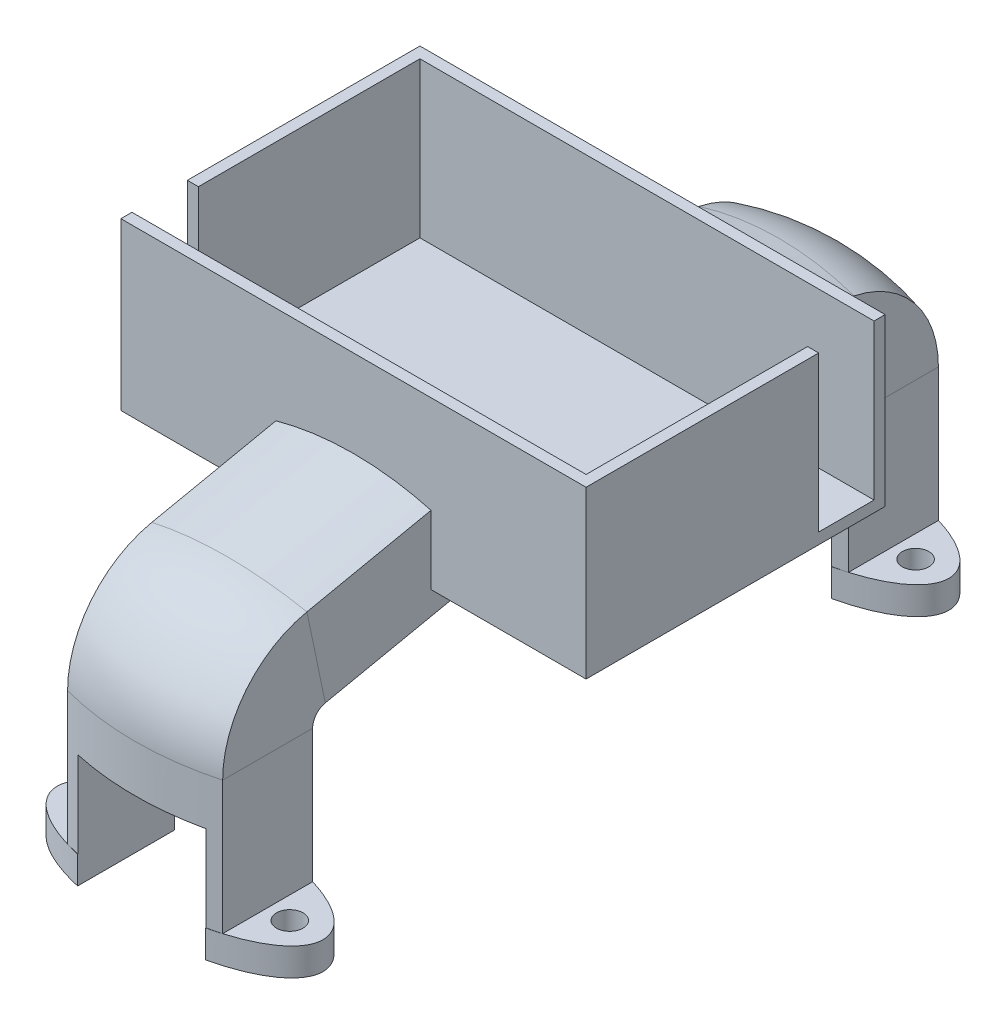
ISO-10303-21;
HEADER;
FILE_DESCRIPTION(('STEP AP214'),'2;1');
FILE_NAME('part.step','',(''),(''),'','','');
FILE_SCHEMA(('AUTOMOTIVE_DESIGN { 1 0 10303 214 1 1 1 1 }'));
ENDSEC;
DATA;
#1=APPLICATION_CONTEXT('core data for automotive mechanical design processes');
#2=APPLICATION_PROTOCOL_DEFINITION('international standard','automotive_design',2000,#1);
#3=PRODUCT_CONTEXT('',#1,'mechanical');
#4=PRODUCT('Part','Part','',(#3));
#5=PRODUCT_RELATED_PRODUCT_CATEGORY('part','',(#4));
#6=PRODUCT_DEFINITION_FORMATION('','',#4);
#7=PRODUCT_DEFINITION_CONTEXT('part definition',#1,'design');
#8=PRODUCT_DEFINITION('design','',#6,#7);
#9=PRODUCT_DEFINITION_SHAPE('','',#8);
#10=(LENGTH_UNIT() NAMED_UNIT(*) SI_UNIT(.MILLI.,.METRE.));
#11=(NAMED_UNIT(*) PLANE_ANGLE_UNIT() SI_UNIT($,.RADIAN.));
#12=(NAMED_UNIT(*) SI_UNIT($,.STERADIAN.) SOLID_ANGLE_UNIT());
#13=UNCERTAINTY_MEASURE_WITH_UNIT(LENGTH_MEASURE(1.E-05),#10,'distance_accuracy_value','');
#14=(GEOMETRIC_REPRESENTATION_CONTEXT(3) GLOBAL_UNCERTAINTY_ASSIGNED_CONTEXT((#13)) GLOBAL_UNIT_ASSIGNED_CONTEXT((#10,
#11,#12)) REPRESENTATION_CONTEXT('',''));
#15=CARTESIAN_POINT('',(0.,0.,0.));
#16=DIRECTION('',(0.,0.,1.));
#17=DIRECTION('',(1.,0.,0.));
#18=AXIS2_PLACEMENT_3D('',#15,#16,#17);
#19=CARTESIAN_POINT('',(0.,35.,0.));
#20=DIRECTION('',(0.,1.,0.));
#21=DIRECTION('',(0.,0.,1.));
#22=AXIS2_PLACEMENT_3D('',#19,#20,#21);
#23=PLANE('',#22);
#24=DIRECTION('',(1.,0.,0.));
#25=VECTOR('',#24,1.);
#26=CARTESIAN_POINT('',(-20.,35.,-15.75));
#27=LINE('',#26,#25);
#28=CARTESIAN_POINT('',(-21.,35.,-15.75));
#29=VERTEX_POINT('',#28);
#30=CARTESIAN_POINT('',(20.,35.,-15.75));
#31=VERTEX_POINT('',#30);
#32=EDGE_CURVE('E654',#29,#31,#27,.T.);
#33=ORIENTED_EDGE('',*,*,#32,.F.);
#34=DIRECTION('',(0.,0.,1.));
#35=VECTOR('',#34,1.);
#36=CARTESIAN_POINT('',(-21.,35.,-14.75));
#37=LINE('',#36,#35);
#38=CARTESIAN_POINT('',(-21.,35.,-14.75));
#39=VERTEX_POINT('',#38);
#40=EDGE_CURVE('E657',#29,#39,#37,.T.);
#41=ORIENTED_EDGE('',*,*,#40,.T.);
#42=DIRECTION('',(1.,0.,0.));
#43=VECTOR('',#42,1.);
#44=CARTESIAN_POINT('',(-21.,35.,-14.75));
#45=LINE('',#44,#43);
#46=CARTESIAN_POINT('',(21.,35.,-14.75));
#47=VERTEX_POINT('',#46);
#48=EDGE_CURVE('E686',#39,#47,#45,.T.);
#49=ORIENTED_EDGE('',*,*,#48,.T.);
#50=DIRECTION('',(0.,0.,-1.));
#51=VECTOR('',#50,1.);
#52=CARTESIAN_POINT('',(21.,35.,-14.75));
#53=LINE('',#52,#51);
#54=CARTESIAN_POINT('',(21.,35.,-35.75));
#55=VERTEX_POINT('',#54);
#56=EDGE_CURVE('E672',#47,#55,#53,.T.);
#57=ORIENTED_EDGE('',*,*,#56,.T.);
#58=DIRECTION('',(1.,0.,0.));
#59=VECTOR('',#58,1.);
#60=CARTESIAN_POINT('',(20.,35.,-35.75));
#61=LINE('',#60,#59);
#62=CARTESIAN_POINT('',(20.,35.,-35.75));
#63=VERTEX_POINT('',#62);
#64=EDGE_CURVE('E1397',#63,#55,#61,.T.);
#65=ORIENTED_EDGE('',*,*,#64,.F.);
#66=DIRECTION('',(0.,0.,-1.));
#67=VECTOR('',#66,1.);
#68=CARTESIAN_POINT('',(20.,35.,-15.75));
#69=LINE('',#68,#67);
#70=EDGE_CURVE('E661',#31,#63,#69,.T.);
#71=ORIENTED_EDGE('',*,*,#70,.F.);
#72=EDGE_LOOP('',(#33,#41,#49,#57,#65,#71));
#73=FACE_BOUND('',#72,.T.);
#74=ADVANCED_FACE('F39',(#73),#23,.T.);
#75=CARTESIAN_POINT('',(0.,45.0131788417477,-17.5220510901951));
#76=DIRECTION('',(0.,-0.204216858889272,0.9789256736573));
#77=DIRECTION('',(0.,-0.9789256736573,-0.204216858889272));
#78=AXIS2_PLACEMENT_3D('',#75,#76,#77);
#79=PLANE('',#78);
#80=DIRECTION('',(-1.,0.,0.));
#81=VECTOR('',#80,1.);
#82=CARTESIAN_POINT('',(0.,20.,-22.7401314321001));
#83=LINE('',#82,#81);
#84=CARTESIAN_POINT('',(6.99999999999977,20.,-22.7401314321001));
#85=VERTEX_POINT('',#84);
#86=CARTESIAN_POINT('',(-6.99999999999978,20.,-22.7401314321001));
#87=VERTEX_POINT('',#86);
#88=EDGE_CURVE('E703',#85,#87,#83,.T.);
#89=ORIENTED_EDGE('',*,*,#88,.F.);
#90=DIRECTION('',(0.,-0.9789256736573,-0.204216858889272));
#91=VECTOR('',#90,1.);
#92=CARTESIAN_POINT('',(6.99999999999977,19.5844166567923,-22.8268276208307));
#93=LINE('',#92,#91);
#94=CARTESIAN_POINT('',(6.99999999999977,19.5844166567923,-22.8268276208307));
#95=VERTEX_POINT('',#94);
#96=EDGE_CURVE('E726',#85,#95,#93,.T.);
#97=ORIENTED_EDGE('',*,*,#96,.T.);
#98=CARTESIAN_POINT('',(0.,45.0131788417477,-17.5220510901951));
#99=DIRECTION('',(0.,0.204216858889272,-0.9789256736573));
#100=DIRECTION('',(0.,-0.9789256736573,-0.204216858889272));
#101=AXIS2_PLACEMENT_3D('',#98,#99,#100);
#102=CIRCLE('',#101,26.9028362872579);
#103=CARTESIAN_POINT('',(-6.99999999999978,19.5844166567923,-22.8268276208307));
#104=VERTEX_POINT('',#103);
#105=EDGE_CURVE('E744',#95,#104,#102,.T.);
#106=ORIENTED_EDGE('',*,*,#105,.T.);
#107=DIRECTION('',(0.,0.9789256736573,0.204216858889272));
#108=VECTOR('',#107,1.);
#109=CARTESIAN_POINT('',(-6.99999999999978,19.5844166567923,-22.8268276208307));
#110=LINE('',#109,#108);
#111=EDGE_CURVE('E756',#104,#87,#110,.T.);
#112=ORIENTED_EDGE('',*,*,#111,.T.);
#113=EDGE_LOOP('',(#89,#97,#106,#112));
#114=FACE_BOUND('',#113,.T.);
#115=ADVANCED_FACE('F570',(#114),#79,.F.);
#116=CARTESIAN_POINT('',(0.,-1.56927359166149,-8.85226326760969));
#117=DIRECTION('',(0.,0.204216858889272,-0.9789256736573));
#118=DIRECTION('',(0.,0.9789256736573,0.204216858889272));
#119=AXIS2_PLACEMENT_3D('',#116,#117,#118);
#120=CYLINDRICAL_SURFACE('',#119,26.9030144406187);
#121=DIRECTION('',(0.,0.204216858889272,-0.9789256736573));
#122=VECTOR('',#121,1.);
#123=CARTESIAN_POINT('',(6.99999999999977,23.8596692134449,-3.54744905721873));
#124=LINE('',#123,#122);
#125=CARTESIAN_POINT('',(6.99999999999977,23.8596692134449,-3.54744905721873));
#126=VERTEX_POINT('',#125);
#127=CARTESIAN_POINT('',(6.99999999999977,26.1966696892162,-14.75));
#128=VERTEX_POINT('',#127);
#129=EDGE_CURVE('E723',#126,#128,#124,.T.);
#130=ORIENTED_EDGE('',*,*,#129,.T.);
#131=CARTESIAN_POINT('',(0.,-0.338927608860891,-14.75));
#132=DIRECTION('',(0.,0.,-1.));
#133=DIRECTION('',(0.,1.,0.));
#134=AXIS2_PLACEMENT_3D('',#131,#132,#133);
#135=ELLIPSE('',#134,27.4821829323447,26.9030144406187);
#136=CARTESIAN_POINT('',(-6.99999999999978,26.1966696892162,-14.75));
#137=VERTEX_POINT('',#136);
#138=EDGE_CURVE('E697',#128,#137,#135,.F.);
#139=ORIENTED_EDGE('',*,*,#138,.T.);
#140=DIRECTION('',(0.,0.204216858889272,-0.9789256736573));
#141=VECTOR('',#140,1.);
#142=CARTESIAN_POINT('',(-6.99999999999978,23.8596692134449,-3.54744905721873));
#143=LINE('',#142,#141);
#144=CARTESIAN_POINT('',(-6.99999999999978,23.8596692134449,-3.54744905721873));
#145=VERTEX_POINT('',#144);
#146=EDGE_CURVE('E727',#145,#137,#143,.T.);
#147=ORIENTED_EDGE('',*,*,#146,.F.);
#148=CARTESIAN_POINT('',(0.,-1.5692735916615,-8.85226326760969));
#149=DIRECTION('',(0.,0.204216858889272,-0.9789256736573));
#150=DIRECTION('',(0.,0.9789256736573,0.204216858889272));
#151=AXIS2_PLACEMENT_3D('',#148,#149,#150);
#152=CIRCLE('',#151,26.9030144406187);
#153=EDGE_CURVE('E712',#145,#126,#152,.T.);
#154=ORIENTED_EDGE('',*,*,#153,.T.);
#155=EDGE_LOOP('',(#130,#139,#147,#154));
#156=FACE_BOUND('',#155,.T.);
#157=ADVANCED_FACE('F566',(#156),#120,.T.);
#158=CARTESIAN_POINT('',(6.99999999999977,15.9085131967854,-5.20616549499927));
#159=DIRECTION('',(1.,0.,0.));
#160=DIRECTION('',(0.,1.,0.));
#161=AXIS2_PLACEMENT_3D('',#158,#159,#160);
#162=PLANE('',#161);
#163=ORIENTED_EDGE('',*,*,#96,.F.);
#164=DIRECTION('',(0.,0.,1.));
#165=VECTOR('',#164,1.);
#166=CARTESIAN_POINT('',(6.99999999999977,20.,-5.20616549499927));
#167=LINE('',#166,#165);
#168=CARTESIAN_POINT('',(6.99999999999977,20.,-14.75));
#169=VERTEX_POINT('',#168);
#170=EDGE_CURVE('E705',#85,#169,#167,.T.);
#171=ORIENTED_EDGE('',*,*,#170,.T.);
#172=DIRECTION('',(0.,1.,0.));
#173=VECTOR('',#172,1.);
#174=CARTESIAN_POINT('',(6.99999999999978,15.9085131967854,-14.75));
#175=LINE('',#174,#173);
#176=EDGE_CURVE('E700',#169,#128,#175,.T.);
#177=ORIENTED_EDGE('',*,*,#176,.T.);
#178=ORIENTED_EDGE('',*,*,#129,.F.);
#179=DIRECTION('',(0.,-0.9789256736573,-0.204216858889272));
#180=VECTOR('',#179,1.);
#181=CARTESIAN_POINT('',(6.99999999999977,15.9085131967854,-5.20616549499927));
#182=LINE('',#181,#180);
#183=CARTESIAN_POINT('',(6.99999999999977,15.9085131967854,-5.20616549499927));
#184=VERTEX_POINT('',#183);
#185=EDGE_CURVE('E719',#126,#184,#182,.T.);
#186=ORIENTED_EDGE('',*,*,#185,.T.);
#187=DIRECTION('',(0.,0.204216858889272,-0.9789256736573));
#188=VECTOR('',#187,1.);
#189=CARTESIAN_POINT('',(6.99999999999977,15.9085131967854,-5.20616549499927));
#190=LINE('',#189,#188);
#191=EDGE_CURVE('E741',#184,#95,#190,.T.);
#192=ORIENTED_EDGE('',*,*,#191,.T.);
#193=EDGE_LOOP('',(#163,#171,#177,#178,#186,#192));
#194=FACE_BOUND('',#193,.T.);
#195=ADVANCED_FACE('F569',(#194),#162,.T.);
#196=CARTESIAN_POINT('',(-6.99999999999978,15.9085131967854,-5.20616549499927));
#197=DIRECTION('',(-1.,0.,0.));
#198=DIRECTION('',(0.,-1.,0.));
#199=AXIS2_PLACEMENT_3D('',#196,#197,#198);
#200=PLANE('',#199);
#201=DIRECTION('',(0.,-1.,0.));
#202=VECTOR('',#201,1.);
#203=CARTESIAN_POINT('',(-6.99999999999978,15.9085131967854,-14.75));
#204=LINE('',#203,#202);
#205=CARTESIAN_POINT('',(-6.99999999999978,20.,-14.75));
#206=VERTEX_POINT('',#205);
#207=EDGE_CURVE('E48',#137,#206,#204,.T.);
#208=ORIENTED_EDGE('',*,*,#207,.T.);
#209=DIRECTION('',(0.,0.,-1.));
#210=VECTOR('',#209,1.);
#211=CARTESIAN_POINT('',(-6.99999999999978,20.,-5.20616549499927));
#212=LINE('',#211,#210);
#213=EDGE_CURVE('E11',#206,#87,#212,.T.);
#214=ORIENTED_EDGE('',*,*,#213,.T.);
#215=ORIENTED_EDGE('',*,*,#111,.F.);
#216=DIRECTION('',(0.,0.204216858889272,-0.9789256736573));
#217=VECTOR('',#216,1.);
#218=CARTESIAN_POINT('',(-6.99999999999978,15.9085131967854,-5.20616549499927));
#219=LINE('',#218,#217);
#220=CARTESIAN_POINT('',(-6.99999999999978,15.9085131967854,-5.20616549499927));
#221=VERTEX_POINT('',#220);
#222=EDGE_CURVE('E753',#221,#104,#219,.T.);
#223=ORIENTED_EDGE('',*,*,#222,.F.);
#224=DIRECTION('',(0.,0.9789256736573,0.204216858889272));
#225=VECTOR('',#224,1.);
#226=CARTESIAN_POINT('',(-6.99999999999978,15.9085131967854,-5.20616549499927));
#227=LINE('',#226,#225);
#228=EDGE_CURVE('E730',#221,#145,#227,.T.);
#229=ORIENTED_EDGE('',*,*,#228,.T.);
#230=ORIENTED_EDGE('',*,*,#146,.T.);
#231=EDGE_LOOP('',(#208,#214,#215,#223,#229,#230));
#232=FACE_BOUND('',#231,.T.);
#233=ADVANCED_FACE('F578',(#232),#200,.T.);
#234=CARTESIAN_POINT('',(0.,2.5,0.));
#235=DIRECTION('',(0.,1.,0.));
#236=DIRECTION('',(0.,0.,1.));
#237=AXIS2_PLACEMENT_3D('',#234,#235,#236);
#238=PLANE('',#237);
#239=DIRECTION('',(0.,0.,-1.));
#240=VECTOR('',#239,1.);
#241=CARTESIAN_POINT('',(5.775,2.5,0.));
#242=LINE('',#241,#240);
#243=CARTESIAN_POINT('',(5.775,2.5,-4.36066307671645));
#244=VERTEX_POINT('',#243);
#245=CARTESIAN_POINT('',(5.775,2.5,-4.3829169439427));
#246=VERTEX_POINT('',#245);
#247=EDGE_CURVE('E793',#244,#246,#242,.T.);
#248=ORIENTED_EDGE('',*,*,#247,.F.);
#249=CARTESIAN_POINT('',(0.,2.5,21.9150286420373));
#250=DIRECTION('',(0.,1.,0.));
#251=DIRECTION('',(0.,0.,-1.));
#252=AXIS2_PLACEMENT_3D('',#249,#250,#251);
#253=CIRCLE('',#252,26.9028362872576);
#254=CARTESIAN_POINT('',(6.99999999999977,2.5,-4.06116431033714));
#255=VERTEX_POINT('',#254);
#256=EDGE_CURVE('E802',#255,#244,#253,.T.);
#257=ORIENTED_EDGE('',*,*,#256,.F.);
#258=CARTESIAN_POINT('',(0.,2.5,0.));
#259=DIRECTION('',(0.,1.,0.));
#260=DIRECTION('',(1.,0.,0.));
#261=AXIS2_PLACEMENT_3D('',#258,#259,#260);
#262=ELLIPSE('',#261,12.,5.);
#263=EDGE_CURVE('E838',#255,#246,#262,.T.);
#264=ORIENTED_EDGE('',*,*,#263,.T.);
#265=EDGE_LOOP('',(#248,#257,#264));
#266=FACE_BOUND('',#265,.T.);
#267=ADVANCED_FACE('F592',(#266),#238,.T.);
#268=DIRECTION('',(0.,0.,-1.));
#269=VECTOR('',#268,1.);
#270=CARTESIAN_POINT('',(5.775,2.5,0.));
#271=LINE('',#270,#269);
#272=CARTESIAN_POINT('',(5.775,2.5,4.3829169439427));
#273=VERTEX_POINT('',#272);
#274=CARTESIAN_POINT('',(5.775,2.5,4.36066097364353));
#275=VERTEX_POINT('',#274);
#276=EDGE_CURVE('E785',#273,#275,#271,.T.);
#277=ORIENTED_EDGE('',*,*,#276,.F.);
#278=CARTESIAN_POINT('',(6.99999999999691,2.5,4.06116431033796));
#279=VERTEX_POINT('',#278);
#280=EDGE_CURVE('E844',#273,#279,#262,.T.);
#281=ORIENTED_EDGE('',*,*,#280,.T.);
#282=CARTESIAN_POINT('',(0.,2.5,-21.9152131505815));
#283=DIRECTION('',(0.,1.,0.));
#284=DIRECTION('',(0.,0.,1.));
#285=AXIS2_PLACEMENT_3D('',#282,#283,#284);
#286=CIRCLE('',#285,26.9030144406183);
#287=EDGE_CURVE('E808',#275,#279,#286,.T.);
#288=ORIENTED_EDGE('',*,*,#287,.F.);
#289=EDGE_LOOP('',(#277,#281,#288));
#290=FACE_BOUND('',#289,.T.);
#291=ADVANCED_FACE('F905',(#290),#238,.T.);
#292=DIRECTION('',(0.,-1.,0.));
#293=VECTOR('',#292,1.);
#294=SURFACE_OF_LINEAR_EXTRUSION('',#262,#293);
#295=CARTESIAN_POINT('',(0.,0.,0.));
#296=DIRECTION('',(0.,1.,0.));
#297=DIRECTION('',(1.,0.,0.));
#298=AXIS2_PLACEMENT_3D('',#295,#296,#297);
#299=ELLIPSE('',#298,12.,5.);
#300=CARTESIAN_POINT('',(5.775,0.,4.3829169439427));
#301=VERTEX_POINT('',#300);
#302=CARTESIAN_POINT('',(5.775,0.,-4.3829169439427));
#303=VERTEX_POINT('',#302);
#304=EDGE_CURVE('E831',#301,#303,#299,.T.);
#305=ORIENTED_EDGE('',*,*,#304,.T.);
#306=DIRECTION('',(0.,-1.,0.));
#307=VECTOR('',#306,1.);
#308=CARTESIAN_POINT('',(5.775,2.5,-4.3829169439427));
#309=LINE('',#308,#307);
#310=EDGE_CURVE('E795',#303,#246,#309,.F.);
#311=ORIENTED_EDGE('',*,*,#310,.T.);
#312=ORIENTED_EDGE('',*,*,#263,.F.);
#313=EDGE_CURVE('E886',#279,#255,#262,.T.);
#314=ORIENTED_EDGE('',*,*,#313,.F.);
#315=ORIENTED_EDGE('',*,*,#280,.F.);
#316=DIRECTION('',(0.,-1.,0.));
#317=VECTOR('',#316,1.);
#318=CARTESIAN_POINT('',(5.775,2.5,4.3829169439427));
#319=LINE('',#318,#317);
#320=EDGE_CURVE('E787',#273,#301,#319,.T.);
#321=ORIENTED_EDGE('',*,*,#320,.T.);
#322=EDGE_LOOP('',(#305,#311,#312,#314,#315,#321));
#323=FACE_BOUND('',#322,.T.);
#324=ADVANCED_FACE('F646',(#323),#294,.F.);
#325=CARTESIAN_POINT('',(0.,0.,0.));
#326=DIRECTION('',(0.,1.,0.));
#327=DIRECTION('',(0.,0.,1.));
#328=AXIS2_PLACEMENT_3D('',#325,#326,#327);
#329=PLANE('',#328);
#330=CARTESIAN_POINT('',(9.,0.,0.));
#331=DIRECTION('',(0.,1.,0.));
#332=DIRECTION('',(0.,0.,1.));
#333=AXIS2_PLACEMENT_3D('',#330,#331,#332);
#334=CIRCLE('',#333,1.2);
#335=CARTESIAN_POINT('',(9.,0.,1.2));
#336=VERTEX_POINT('',#335);
#337=EDGE_CURVE('E828',#336,#336,#334,.T.);
#338=ORIENTED_EDGE('',*,*,#337,.T.);
#339=EDGE_LOOP('',(#338));
#340=FACE_BOUND('',#339,.T.);
#341=ORIENTED_EDGE('',*,*,#304,.F.);
#342=DIRECTION('',(0.,0.,1.));
#343=VECTOR('',#342,1.);
#344=CARTESIAN_POINT('',(5.775,0.,-10.));
#345=LINE('',#344,#343);
#346=EDGE_CURVE('E767',#303,#301,#345,.T.);
#347=ORIENTED_EDGE('',*,*,#346,.F.);
#348=EDGE_LOOP('',(#341,#347));
#349=FACE_BOUND('',#348,.T.);
#350=ADVANCED_FACE('F638',(#340,#349),#329,.F.);
#351=DIRECTION('',(0.,0.,1.));
#352=VECTOR('',#351,1.);
#353=CARTESIAN_POINT('',(-5.775,2.5,0.));
#354=LINE('',#353,#352);
#355=CARTESIAN_POINT('',(-5.775,2.5,-4.3829169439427));
#356=VERTEX_POINT('',#355);
#357=CARTESIAN_POINT('',(-5.775,2.5,-4.36066307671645));
#358=VERTEX_POINT('',#357);
#359=EDGE_CURVE('E780',#356,#358,#354,.T.);
#360=ORIENTED_EDGE('',*,*,#359,.F.);
#361=CARTESIAN_POINT('',(-6.99999999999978,2.5,-4.06116431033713));
#362=VERTEX_POINT('',#361);
#363=EDGE_CURVE('E843',#356,#362,#262,.T.);
#364=ORIENTED_EDGE('',*,*,#363,.T.);
#365=EDGE_CURVE('E801',#358,#362,#253,.T.);
#366=ORIENTED_EDGE('',*,*,#365,.F.);
#367=EDGE_LOOP('',(#360,#364,#366));
#368=FACE_BOUND('',#367,.T.);
#369=ADVANCED_FACE('F645',(#368),#238,.T.);
#370=DIRECTION('',(0.,0.,-1.));
#371=VECTOR('',#370,1.);
#372=CARTESIAN_POINT('',(6.99999999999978,2.5,4.06116431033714));
#373=LINE('',#372,#371);
#374=EDGE_CURVE('E812',#279,#255,#373,.T.);
#375=ORIENTED_EDGE('',*,*,#374,.F.);
#376=ORIENTED_EDGE('',*,*,#313,.T.);
#377=EDGE_LOOP('',(#375,#376));
#378=FACE_BOUND('',#377,.T.);
#379=CARTESIAN_POINT('',(9.,2.5,0.));
#380=DIRECTION('',(0.,1.,0.));
#381=DIRECTION('',(0.,0.,1.));
#382=AXIS2_PLACEMENT_3D('',#379,#380,#381);
#383=CIRCLE('',#382,1.2);
#384=CARTESIAN_POINT('',(9.,2.5,1.2));
#385=VERTEX_POINT('',#384);
#386=EDGE_CURVE('E832',#385,#385,#383,.T.);
#387=ORIENTED_EDGE('',*,*,#386,.F.);
#388=EDGE_LOOP('',(#387));
#389=FACE_BOUND('',#388,.T.);
#390=ADVANCED_FACE('F912',(#378,#389),#238,.T.);
#391=DIRECTION('',(0.,0.,1.));
#392=VECTOR('',#391,1.);
#393=CARTESIAN_POINT('',(-5.775,2.5,0.));
#394=LINE('',#393,#392);
#395=CARTESIAN_POINT('',(-5.775,2.5,4.36066097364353));
#396=VERTEX_POINT('',#395);
#397=CARTESIAN_POINT('',(-5.775,2.5,4.3829169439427));
#398=VERTEX_POINT('',#397);
#399=EDGE_CURVE('E766',#396,#398,#394,.T.);
#400=ORIENTED_EDGE('',*,*,#399,.F.);
#401=CARTESIAN_POINT('',(-6.99999999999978,2.5,4.06116431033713));
#402=VERTEX_POINT('',#401);
#403=EDGE_CURVE('E809',#402,#396,#286,.T.);
#404=ORIENTED_EDGE('',*,*,#403,.F.);
#405=EDGE_CURVE('E884',#402,#398,#262,.T.);
#406=ORIENTED_EDGE('',*,*,#405,.T.);
#407=EDGE_LOOP('',(#400,#404,#406));
#408=FACE_BOUND('',#407,.T.);
#409=ADVANCED_FACE('F635',(#408),#238,.T.);
#410=CARTESIAN_POINT('',(-5.775,0.,-4.3829169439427));
#411=VERTEX_POINT('',#410);
#412=CARTESIAN_POINT('',(-5.775,0.,4.3829169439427));
#413=VERTEX_POINT('',#412);
#414=EDGE_CURVE('E848',#411,#413,#299,.T.);
#415=ORIENTED_EDGE('',*,*,#414,.T.);
#416=DIRECTION('',(0.,-1.,0.));
#417=VECTOR('',#416,1.);
#418=CARTESIAN_POINT('',(-5.775,2.5,4.3829169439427));
#419=LINE('',#418,#417);
#420=EDGE_CURVE('E774',#413,#398,#419,.F.);
#421=ORIENTED_EDGE('',*,*,#420,.T.);
#422=ORIENTED_EDGE('',*,*,#405,.F.);
#423=EDGE_CURVE('E845',#362,#402,#262,.T.);
#424=ORIENTED_EDGE('',*,*,#423,.F.);
#425=ORIENTED_EDGE('',*,*,#363,.F.);
#426=DIRECTION('',(0.,-1.,0.));
#427=VECTOR('',#426,1.);
#428=CARTESIAN_POINT('',(-5.775,2.5,-4.3829169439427));
#429=LINE('',#428,#427);
#430=EDGE_CURVE('E782',#356,#411,#429,.T.);
#431=ORIENTED_EDGE('',*,*,#430,.T.);
#432=EDGE_LOOP('',(#415,#421,#422,#424,#425,#431));
#433=FACE_BOUND('',#432,.T.);
#434=ADVANCED_FACE('F41',(#433),#294,.F.);
#435=DIRECTION('',(0.,0.,1.));
#436=VECTOR('',#435,1.);
#437=CARTESIAN_POINT('',(-6.99999999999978,2.5,4.06116431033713));
#438=LINE('',#437,#436);
#439=EDGE_CURVE('E805',#362,#402,#438,.T.);
#440=ORIENTED_EDGE('',*,*,#439,.F.);
#441=ORIENTED_EDGE('',*,*,#423,.T.);
#442=EDGE_LOOP('',(#440,#441));
#443=FACE_BOUND('',#442,.T.);
#444=CARTESIAN_POINT('',(-9.,2.5,0.));
#445=DIRECTION('',(0.,1.,0.));
#446=DIRECTION('',(0.,0.,1.));
#447=AXIS2_PLACEMENT_3D('',#444,#445,#446);
#448=CIRCLE('',#447,1.2);
#449=CARTESIAN_POINT('',(-9.,2.5,1.2));
#450=VERTEX_POINT('',#449);
#451=EDGE_CURVE('E835',#450,#450,#448,.T.);
#452=ORIENTED_EDGE('',*,*,#451,.F.);
#453=EDGE_LOOP('',(#452));
#454=FACE_BOUND('',#453,.T.);
#455=ADVANCED_FACE('F632',(#443,#454),#238,.T.);
#456=CARTESIAN_POINT('',(-9.,0.,0.));
#457=DIRECTION('',(0.,1.,0.));
#458=DIRECTION('',(0.,0.,1.));
#459=AXIS2_PLACEMENT_3D('',#456,#457,#458);
#460=CIRCLE('',#459,1.2);
#461=CARTESIAN_POINT('',(-9.,0.,1.2));
#462=VERTEX_POINT('',#461);
#463=EDGE_CURVE('E827',#462,#462,#460,.T.);
#464=ORIENTED_EDGE('',*,*,#463,.T.);
#465=EDGE_LOOP('',(#464));
#466=FACE_BOUND('',#465,.T.);
#467=ORIENTED_EDGE('',*,*,#414,.F.);
#468=DIRECTION('',(0.,0.,1.));
#469=VECTOR('',#468,1.);
#470=CARTESIAN_POINT('',(-5.775,0.,-10.));
#471=LINE('',#470,#469);
#472=EDGE_CURVE('E769',#411,#413,#471,.T.);
#473=ORIENTED_EDGE('',*,*,#472,.T.);
#474=EDGE_LOOP('',(#467,#473));
#475=FACE_BOUND('',#474,.T.);
#476=ADVANCED_FACE('F630',(#466,#475),#329,.F.);
#477=CARTESIAN_POINT('',(-9.,0.,0.));
#478=DIRECTION('',(0.,1.,0.));
#479=DIRECTION('',(0.,0.,1.));
#480=AXIS2_PLACEMENT_3D('',#477,#478,#479);
#481=CYLINDRICAL_SURFACE('',#480,1.2);
#482=ORIENTED_EDGE('',*,*,#463,.F.);
#483=EDGE_LOOP('',(#482));
#484=FACE_BOUND('',#483,.T.);
#485=ORIENTED_EDGE('',*,*,#451,.T.);
#486=EDGE_LOOP('',(#485));
#487=FACE_BOUND('',#486,.T.);
#488=ADVANCED_FACE('F626',(#484,#487),#481,.F.);
#489=CARTESIAN_POINT('',(9.,0.,0.));
#490=DIRECTION('',(0.,1.,0.));
#491=DIRECTION('',(0.,0.,1.));
#492=AXIS2_PLACEMENT_3D('',#489,#490,#491);
#493=CYLINDRICAL_SURFACE('',#492,1.2);
#494=ORIENTED_EDGE('',*,*,#337,.F.);
#495=EDGE_LOOP('',(#494));
#496=FACE_BOUND('',#495,.T.);
#497=ORIENTED_EDGE('',*,*,#386,.T.);
#498=EDGE_LOOP('',(#497));
#499=FACE_BOUND('',#498,.T.);
#500=ADVANCED_FACE('F622',(#496,#499),#493,.F.);
#501=CARTESIAN_POINT('',(0.,11.5,21.9150286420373));
#502=DIRECTION('',(0.,-1.,0.));
#503=DIRECTION('',(0.,0.,-1.));
#504=AXIS2_PLACEMENT_3D('',#501,#502,#503);
#505=CYLINDRICAL_SURFACE('',#504,26.9028362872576);
#506=ORIENTED_EDGE('',*,*,#256,.T.);
#507=DIRECTION('',(0.,-1.,0.));
#508=VECTOR('',#507,1.);
#509=CARTESIAN_POINT('',(5.775,11.5,-4.36066307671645));
#510=LINE('',#509,#508);
#511=CARTESIAN_POINT('',(5.775,10.25,-4.36066307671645));
#512=VERTEX_POINT('',#511);
#513=EDGE_CURVE('E790',#244,#512,#510,.F.);
#514=ORIENTED_EDGE('',*,*,#513,.T.);
#515=CARTESIAN_POINT('',(0.,10.25,21.9150286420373));
#516=DIRECTION('',(0.,1.,0.));
#517=DIRECTION('',(-1.,0.,0.));
#518=AXIS2_PLACEMENT_3D('',#515,#516,#517);
#519=CIRCLE('',#518,26.9028362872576);
#520=CARTESIAN_POINT('',(-5.775,10.25,-4.36066307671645));
#521=VERTEX_POINT('',#520);
#522=EDGE_CURVE('E798',#512,#521,#519,.T.);
#523=ORIENTED_EDGE('',*,*,#522,.T.);
#524=DIRECTION('',(0.,-1.,0.));
#525=VECTOR('',#524,1.);
#526=CARTESIAN_POINT('',(-5.775,11.5,-4.36066307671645));
#527=LINE('',#526,#525);
#528=EDGE_CURVE('E777',#521,#358,#527,.T.);
#529=ORIENTED_EDGE('',*,*,#528,.T.);
#530=ORIENTED_EDGE('',*,*,#365,.T.);
#531=DIRECTION('',(0.,-1.,0.));
#532=VECTOR('',#531,1.);
#533=CARTESIAN_POINT('',(-6.99999999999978,11.5,-4.06116431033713));
#534=LINE('',#533,#532);
#535=CARTESIAN_POINT('',(-6.99999999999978,14.5,-4.06116431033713));
#536=VERTEX_POINT('',#535);
#537=EDGE_CURVE('E824',#536,#362,#534,.T.);
#538=ORIENTED_EDGE('',*,*,#537,.F.);
#539=CARTESIAN_POINT('',(0.,14.5,21.9150286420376));
#540=DIRECTION('',(0.,1.,0.));
#541=DIRECTION('',(0.,0.,-1.));
#542=AXIS2_PLACEMENT_3D('',#539,#540,#541);
#543=CIRCLE('',#542,26.9028362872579);
#544=CARTESIAN_POINT('',(6.99999999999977,14.5,-4.06116431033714));
#545=VERTEX_POINT('',#544);
#546=EDGE_CURVE('E733',#545,#536,#543,.T.);
#547=ORIENTED_EDGE('',*,*,#546,.F.);
#548=DIRECTION('',(0.,-1.,0.));
#549=VECTOR('',#548,1.);
#550=CARTESIAN_POINT('',(6.99999999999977,11.5,-4.06116431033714));
#551=LINE('',#550,#549);
#552=EDGE_CURVE('E815',#545,#255,#551,.T.);
#553=ORIENTED_EDGE('',*,*,#552,.T.);
#554=EDGE_LOOP('',(#506,#514,#523,#529,#530,#538,#547,#553));
#555=FACE_BOUND('',#554,.T.);
#556=ADVANCED_FACE('F618',(#555),#505,.T.);
#557=CARTESIAN_POINT('',(-6.99999999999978,11.5,4.06116431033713));
#558=DIRECTION('',(1.,0.,0.));
#559=DIRECTION('',(0.,0.,-1.));
#560=AXIS2_PLACEMENT_3D('',#557,#558,#559);
#561=PLANE('',#560);
#562=ORIENTED_EDGE('',*,*,#439,.T.);
#563=DIRECTION('',(0.,-1.,0.));
#564=VECTOR('',#563,1.);
#565=CARTESIAN_POINT('',(-6.99999999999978,11.5,4.06116431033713));
#566=LINE('',#565,#564);
#567=CARTESIAN_POINT('',(-6.99999999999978,14.5,4.06116431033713));
#568=VERTEX_POINT('',#567);
#569=EDGE_CURVE('E821',#568,#402,#566,.T.);
#570=ORIENTED_EDGE('',*,*,#569,.F.);
#571=DIRECTION('',(0.,0.,1.));
#572=VECTOR('',#571,1.);
#573=CARTESIAN_POINT('',(-6.99999999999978,14.5,-4.06116431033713));
#574=LINE('',#573,#572);
#575=EDGE_CURVE('E722',#536,#568,#574,.T.);
#576=ORIENTED_EDGE('',*,*,#575,.F.);
#577=ORIENTED_EDGE('',*,*,#537,.T.);
#578=EDGE_LOOP('',(#562,#570,#576,#577));
#579=FACE_BOUND('',#578,.T.);
#580=ADVANCED_FACE('F614',(#579),#561,.F.);
#581=CARTESIAN_POINT('',(0.,11.5,-21.9152131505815));
#582=DIRECTION('',(0.,-1.,0.));
#583=DIRECTION('',(0.,0.,-1.));
#584=AXIS2_PLACEMENT_3D('',#581,#582,#583);
#585=CYLINDRICAL_SURFACE('',#584,26.9030144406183);
#586=CARTESIAN_POINT('',(0.,10.25,-21.9152131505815));
#587=DIRECTION('',(0.,1.,0.));
#588=DIRECTION('',(-1.,0.,0.));
#589=AXIS2_PLACEMENT_3D('',#586,#587,#588);
#590=CIRCLE('',#589,26.9030144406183);
#591=CARTESIAN_POINT('',(-5.775,10.25,4.36066097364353));
#592=VERTEX_POINT('',#591);
#593=CARTESIAN_POINT('',(5.775,10.25,4.36066097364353));
#594=VERTEX_POINT('',#593);
#595=EDGE_CURVE('E851',#592,#594,#590,.T.);
#596=ORIENTED_EDGE('',*,*,#595,.T.);
#597=DIRECTION('',(0.,-1.,0.));
#598=VECTOR('',#597,1.);
#599=CARTESIAN_POINT('',(5.775,11.5,4.36066097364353));
#600=LINE('',#599,#598);
#601=EDGE_CURVE('E854',#594,#275,#600,.T.);
#602=ORIENTED_EDGE('',*,*,#601,.T.);
#603=ORIENTED_EDGE('',*,*,#287,.T.);
#604=DIRECTION('',(0.,-1.,0.));
#605=VECTOR('',#604,1.);
#606=CARTESIAN_POINT('',(6.99999999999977,11.5,4.06116431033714));
#607=LINE('',#606,#605);
#608=CARTESIAN_POINT('',(6.99999999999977,14.5,4.06116431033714));
#609=VERTEX_POINT('',#608);
#610=EDGE_CURVE('E818',#609,#279,#607,.T.);
#611=ORIENTED_EDGE('',*,*,#610,.F.);
#612=CARTESIAN_POINT('',(0.,14.5,-21.9152131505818));
#613=DIRECTION('',(0.,1.,0.));
#614=DIRECTION('',(0.,0.,1.));
#615=AXIS2_PLACEMENT_3D('',#612,#613,#614);
#616=CIRCLE('',#615,26.9030144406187);
#617=EDGE_CURVE('E708',#568,#609,#616,.T.);
#618=ORIENTED_EDGE('',*,*,#617,.F.);
#619=ORIENTED_EDGE('',*,*,#569,.T.);
#620=ORIENTED_EDGE('',*,*,#403,.T.);
#621=DIRECTION('',(0.,-1.,0.));
#622=VECTOR('',#621,1.);
#623=CARTESIAN_POINT('',(-5.775,11.5,4.36066097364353));
#624=LINE('',#623,#622);
#625=EDGE_CURVE('E842',#396,#592,#624,.F.);
#626=ORIENTED_EDGE('',*,*,#625,.T.);
#627=EDGE_LOOP('',(#596,#602,#603,#611,#618,#619,#620,#626));
#628=FACE_BOUND('',#627,.T.);
#629=ADVANCED_FACE('F610',(#628),#585,.T.);
#630=CARTESIAN_POINT('',(6.99999999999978,11.5,4.06116431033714));
#631=DIRECTION('',(-1.,0.,0.));
#632=DIRECTION('',(0.,0.,1.));
#633=AXIS2_PLACEMENT_3D('',#630,#631,#632);
#634=PLANE('',#633);
#635=ORIENTED_EDGE('',*,*,#374,.T.);
#636=ORIENTED_EDGE('',*,*,#552,.F.);
#637=DIRECTION('',(0.,0.,-1.));
#638=VECTOR('',#637,1.);
#639=CARTESIAN_POINT('',(6.99999999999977,14.5,-4.06116431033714));
#640=LINE('',#639,#638);
#641=EDGE_CURVE('E711',#609,#545,#640,.T.);
#642=ORIENTED_EDGE('',*,*,#641,.F.);
#643=ORIENTED_EDGE('',*,*,#610,.T.);
#644=EDGE_LOOP('',(#635,#636,#642,#643));
#645=FACE_BOUND('',#644,.T.);
#646=ADVANCED_FACE('F606',(#645),#634,.F.);
#647=CARTESIAN_POINT('',(5.775,10.25,-10.));
#648=DIRECTION('',(0.,1.,0.));
#649=DIRECTION('',(-1.,0.,0.));
#650=AXIS2_PLACEMENT_3D('',#647,#648,#649);
#651=PLANE('',#650);
#652=DIRECTION('',(0.,0.,1.));
#653=VECTOR('',#652,1.);
#654=CARTESIAN_POINT('',(5.775,10.25,-10.));
#655=LINE('',#654,#653);
#656=EDGE_CURVE('E763',#512,#594,#655,.T.);
#657=ORIENTED_EDGE('',*,*,#656,.T.);
#658=ORIENTED_EDGE('',*,*,#595,.F.);
#659=DIRECTION('',(0.,0.,1.));
#660=VECTOR('',#659,1.);
#661=CARTESIAN_POINT('',(-5.775,10.25,-10.));
#662=LINE('',#661,#660);
#663=EDGE_CURVE('E63',#521,#592,#662,.T.);
#664=ORIENTED_EDGE('',*,*,#663,.F.);
#665=ORIENTED_EDGE('',*,*,#522,.F.);
#666=EDGE_LOOP('',(#657,#658,#664,#665));
#667=FACE_BOUND('',#666,.T.);
#668=ADVANCED_FACE('F600',(#667),#651,.F.);
#669=CARTESIAN_POINT('',(5.775,0.,-10.));
#670=DIRECTION('',(1.,0.,0.));
#671=DIRECTION('',(0.,1.,0.));
#672=AXIS2_PLACEMENT_3D('',#669,#670,#671);
#673=PLANE('',#672);
#674=ORIENTED_EDGE('',*,*,#346,.T.);
#675=ORIENTED_EDGE('',*,*,#320,.F.);
#676=ORIENTED_EDGE('',*,*,#276,.T.);
#677=ORIENTED_EDGE('',*,*,#601,.F.);
#678=ORIENTED_EDGE('',*,*,#656,.F.);
#679=ORIENTED_EDGE('',*,*,#513,.F.);
#680=ORIENTED_EDGE('',*,*,#247,.T.);
#681=ORIENTED_EDGE('',*,*,#310,.F.);
#682=EDGE_LOOP('',(#674,#675,#676,#677,#678,#679,#680,#681));
#683=FACE_BOUND('',#682,.T.);
#684=ADVANCED_FACE('F597',(#683),#673,.F.);
#685=CARTESIAN_POINT('',(-5.775,10.25,-10.));
#686=DIRECTION('',(-1.,0.,0.));
#687=DIRECTION('',(0.,-1.,0.));
#688=AXIS2_PLACEMENT_3D('',#685,#686,#687);
#689=PLANE('',#688);
#690=ORIENTED_EDGE('',*,*,#359,.T.);
#691=ORIENTED_EDGE('',*,*,#528,.F.);
#692=ORIENTED_EDGE('',*,*,#663,.T.);
#693=ORIENTED_EDGE('',*,*,#625,.F.);
#694=ORIENTED_EDGE('',*,*,#399,.T.);
#695=ORIENTED_EDGE('',*,*,#420,.F.);
#696=ORIENTED_EDGE('',*,*,#472,.F.);
#697=ORIENTED_EDGE('',*,*,#430,.F.);
#698=EDGE_LOOP('',(#690,#691,#692,#693,#694,#695,#696,#697));
#699=FACE_BOUND('',#698,.T.);
#700=ADVANCED_FACE('F564',(#699),#689,.F.);
#701=CARTESIAN_POINT('',(0.,14.5,-5.5));
#702=DIRECTION('',(-1.,0.,0.));
#703=DIRECTION('',(0.,0.,1.));
#704=AXIS2_PLACEMENT_3D('',#701,#702,#703);
#705=DEGENERATE_TOROIDAL_SURFACE('',#704,16.4152131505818,26.9030144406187,.F.);
#706=CARTESIAN_POINT('',(6.99999999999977,14.5,-5.5));
#707=DIRECTION('',(-1.,0.,0.));
#708=DIRECTION('',(0.,0.,1.));
#709=AXIS2_PLACEMENT_3D('',#706,#707,#708);
#710=CIRCLE('',#709,9.56116431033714);
#711=EDGE_CURVE('E715',#609,#126,#710,.T.);
#712=ORIENTED_EDGE('',*,*,#711,.T.);
#713=ORIENTED_EDGE('',*,*,#153,.F.);
#714=CARTESIAN_POINT('',(-6.99999999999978,14.5,-5.5));
#715=DIRECTION('',(-1.,0.,0.));
#716=DIRECTION('',(0.,0.,1.));
#717=AXIS2_PLACEMENT_3D('',#714,#715,#716);
#718=CIRCLE('',#717,9.56116431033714);
#719=EDGE_CURVE('E716',#568,#145,#718,.T.);
#720=ORIENTED_EDGE('',*,*,#719,.F.);
#721=ORIENTED_EDGE('',*,*,#617,.T.);
#722=EDGE_LOOP('',(#712,#713,#720,#721));
#723=FACE_BOUND('',#722,.T.);
#724=ADVANCED_FACE('F543',(#723),#705,.F.);
#725=CARTESIAN_POINT('',(6.99999999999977,14.5,-4.06116431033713));
#726=DIRECTION('',(1.,0.,0.));
#727=DIRECTION('',(0.,0.,-1.));
#728=AXIS2_PLACEMENT_3D('',#725,#726,#727);
#729=PLANE('',#728);
#730=CARTESIAN_POINT('',(6.99999999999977,14.5,-5.5));
#731=DIRECTION('',(-1.,0.,0.));
#732=DIRECTION('',(0.,0.,1.));
#733=AXIS2_PLACEMENT_3D('',#730,#731,#732);
#734=CIRCLE('',#733,1.43883568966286);
#735=EDGE_CURVE('E736',#545,#184,#734,.T.);
#736=ORIENTED_EDGE('',*,*,#735,.T.);
#737=ORIENTED_EDGE('',*,*,#185,.F.);
#738=ORIENTED_EDGE('',*,*,#711,.F.);
#739=ORIENTED_EDGE('',*,*,#641,.T.);
#740=EDGE_LOOP('',(#736,#737,#738,#739));
#741=FACE_BOUND('',#740,.T.);
#742=ADVANCED_FACE('F563',(#741),#729,.T.);
#743=CARTESIAN_POINT('',(0.,14.5,-5.5));
#744=DIRECTION('',(-1.,0.,0.));
#745=DIRECTION('',(0.,0.,1.));
#746=AXIS2_PLACEMENT_3D('',#743,#744,#745);
#747=TOROIDAL_SURFACE('',#746,27.4150286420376,26.9028362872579);
#748=CARTESIAN_POINT('',(-6.99999999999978,14.5,-5.5));
#749=DIRECTION('',(-1.,0.,0.));
#750=DIRECTION('',(0.,0.,1.));
#751=AXIS2_PLACEMENT_3D('',#748,#749,#750);
#752=CIRCLE('',#751,1.43883568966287);
#753=EDGE_CURVE('E749',#536,#221,#752,.T.);
#754=ORIENTED_EDGE('',*,*,#753,.T.);
#755=CARTESIAN_POINT('',(0.,41.3372753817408,0.0986110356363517));
#756=DIRECTION('',(0.,0.204216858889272,-0.9789256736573));
#757=DIRECTION('',(0.,-0.9789256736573,-0.204216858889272));
#758=AXIS2_PLACEMENT_3D('',#755,#756,#757);
#759=CIRCLE('',#758,26.9028362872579);
#760=EDGE_CURVE('E739',#184,#221,#759,.T.);
#761=ORIENTED_EDGE('',*,*,#760,.F.);
#762=ORIENTED_EDGE('',*,*,#735,.F.);
#763=ORIENTED_EDGE('',*,*,#546,.T.);
#764=EDGE_LOOP('',(#754,#761,#762,#763));
#765=FACE_BOUND('',#764,.T.);
#766=ADVANCED_FACE('F574',(#765),#747,.T.);
#767=CARTESIAN_POINT('',(-6.99999999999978,14.5,-4.06116431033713));
#768=DIRECTION('',(-1.,0.,0.));
#769=DIRECTION('',(0.,0.,1.));
#770=AXIS2_PLACEMENT_3D('',#767,#768,#769);
#771=PLANE('',#770);
#772=ORIENTED_EDGE('',*,*,#228,.F.);
#773=ORIENTED_EDGE('',*,*,#753,.F.);
#774=ORIENTED_EDGE('',*,*,#575,.T.);
#775=ORIENTED_EDGE('',*,*,#719,.T.);
#776=EDGE_LOOP('',(#772,#773,#774,#775));
#777=FACE_BOUND('',#776,.T.);
#778=ADVANCED_FACE('F582',(#777),#771,.T.);
#779=CARTESIAN_POINT('',(0.,41.3372753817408,0.0986110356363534));
#780=DIRECTION('',(0.,0.204216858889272,-0.9789256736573));
#781=DIRECTION('',(0.,0.9789256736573,0.204216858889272));
#782=AXIS2_PLACEMENT_3D('',#779,#780,#781);
#783=CYLINDRICAL_SURFACE('',#782,26.9028362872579);
#784=ORIENTED_EDGE('',*,*,#222,.T.);
#785=ORIENTED_EDGE('',*,*,#105,.F.);
#786=ORIENTED_EDGE('',*,*,#191,.F.);
#787=ORIENTED_EDGE('',*,*,#760,.T.);
#788=EDGE_LOOP('',(#784,#785,#786,#787));
#789=FACE_BOUND('',#788,.T.);
#790=ADVANCED_FACE('F541',(#789),#783,.T.);
#791=DIRECTION('',(-1.,0.,0.));
#792=VECTOR('',#791,1.);
#793=CARTESIAN_POINT('',(-20.,35.,-20.75));
#794=LINE('',#793,#792);
#795=CARTESIAN_POINT('',(-20.,35.,-20.75));
#796=VERTEX_POINT('',#795);
#797=CARTESIAN_POINT('',(-21.,35.,-20.75));
#798=VERTEX_POINT('',#797);
#799=EDGE_CURVE('E357',#796,#798,#794,.T.);
#800=ORIENTED_EDGE('',*,*,#799,.F.);
#801=DIRECTION('',(0.,0.,1.));
#802=VECTOR('',#801,1.);
#803=CARTESIAN_POINT('',(-20.,35.,-15.75));
#804=LINE('',#803,#802);
#805=CARTESIAN_POINT('',(-20.,35.,-40.75));
#806=VERTEX_POINT('',#805);
#807=EDGE_CURVE('E366',#806,#796,#804,.T.);
#808=ORIENTED_EDGE('',*,*,#807,.F.);
#809=DIRECTION('',(-1.,0.,0.));
#810=VECTOR('',#809,1.);
#811=CARTESIAN_POINT('',(-20.,35.,-40.75));
#812=LINE('',#811,#810);
#813=CARTESIAN_POINT('',(21.,35.,-40.75));
#814=VERTEX_POINT('',#813);
#815=EDGE_CURVE('E1420',#814,#806,#812,.T.);
#816=ORIENTED_EDGE('',*,*,#815,.F.);
#817=CARTESIAN_POINT('',(21.,35.,-41.75));
#818=VERTEX_POINT('',#817);
#819=EDGE_CURVE('E1412',#814,#818,#53,.T.);
#820=ORIENTED_EDGE('',*,*,#819,.T.);
#821=DIRECTION('',(-1.,0.,0.));
#822=VECTOR('',#821,1.);
#823=CARTESIAN_POINT('',(-21.,35.,-41.75));
#824=LINE('',#823,#822);
#825=CARTESIAN_POINT('',(-21.,35.,-41.75));
#826=VERTEX_POINT('',#825);
#827=EDGE_CURVE('E669',#818,#826,#824,.T.);
#828=ORIENTED_EDGE('',*,*,#827,.T.);
#829=EDGE_CURVE('E668',#826,#798,#37,.T.);
#830=ORIENTED_EDGE('',*,*,#829,.T.);
#831=EDGE_LOOP('',(#800,#808,#816,#820,#828,#830));
#832=FACE_BOUND('',#831,.T.);
#833=ADVANCED_FACE('F537',(#832),#23,.T.);
#834=CARTESIAN_POINT('',(0.,20.,0.));
#835=DIRECTION('',(0.,1.,0.));
#836=DIRECTION('',(0.,0.,1.));
#837=AXIS2_PLACEMENT_3D('',#834,#835,#836);
#838=PLANE('',#837);
#839=ORIENTED_EDGE('',*,*,#170,.F.);
#840=ORIENTED_EDGE('',*,*,#88,.T.);
#841=ORIENTED_EDGE('',*,*,#213,.F.);
#842=DIRECTION('',(1.,0.,0.));
#843=VECTOR('',#842,1.);
#844=CARTESIAN_POINT('',(-21.,20.,-14.75));
#845=LINE('',#844,#843);
#846=CARTESIAN_POINT('',(-21.,20.,-14.75));
#847=VERTEX_POINT('',#846);
#848=EDGE_CURVE('E55',#847,#206,#845,.T.);
#849=ORIENTED_EDGE('',*,*,#848,.F.);
#850=DIRECTION('',(0.,0.,1.));
#851=VECTOR('',#850,1.);
#852=CARTESIAN_POINT('',(-21.,20.,-14.75));
#853=LINE('',#852,#851);
#854=CARTESIAN_POINT('',(-21.,20.,-41.75));
#855=VERTEX_POINT('',#854);
#856=EDGE_CURVE('E684',#855,#847,#853,.T.);
#857=ORIENTED_EDGE('',*,*,#856,.F.);
#858=DIRECTION('',(-1.,0.,0.));
#859=VECTOR('',#858,1.);
#860=CARTESIAN_POINT('',(-21.,20.,-41.75));
#861=LINE('',#860,#859);
#862=CARTESIAN_POINT('',(-6.99999999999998,20.,-41.75));
#863=VERTEX_POINT('',#862);
#864=EDGE_CURVE('E680',#863,#855,#861,.T.);
#865=ORIENTED_EDGE('',*,*,#864,.F.);
#866=DIRECTION('',(0.,0.,1.));
#867=VECTOR('',#866,1.);
#868=CARTESIAN_POINT('',(-6.99999999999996,20.,0.));
#869=LINE('',#868,#867);
#870=CARTESIAN_POINT('',(-6.99999999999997,20.,-33.7598685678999));
#871=VERTEX_POINT('',#870);
#872=EDGE_CURVE('E1434',#863,#871,#869,.T.);
#873=ORIENTED_EDGE('',*,*,#872,.T.);
#874=DIRECTION('',(-1.,0.,0.));
#875=VECTOR('',#874,1.);
#876=CARTESIAN_POINT('',(0.,20.,-33.7598685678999));
#877=LINE('',#876,#875);
#878=CARTESIAN_POINT('',(7.00000000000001,20.,-33.7598685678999));
#879=VERTEX_POINT('',#878);
#880=EDGE_CURVE('E1426',#879,#871,#877,.T.);
#881=ORIENTED_EDGE('',*,*,#880,.F.);
#882=DIRECTION('',(0.,0.,-1.));
#883=VECTOR('',#882,1.);
#884=CARTESIAN_POINT('',(7.00000000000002,20.,0.));
#885=LINE('',#884,#883);
#886=CARTESIAN_POINT('',(7.00000000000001,20.,-41.75));
#887=VERTEX_POINT('',#886);
#888=EDGE_CURVE('E1428',#879,#887,#885,.T.);
#889=ORIENTED_EDGE('',*,*,#888,.T.);
#890=CARTESIAN_POINT('',(21.,20.,-41.75));
#891=VERTEX_POINT('',#890);
#892=EDGE_CURVE('E681',#891,#887,#861,.T.);
#893=ORIENTED_EDGE('',*,*,#892,.F.);
#894=DIRECTION('',(0.,0.,-1.));
#895=VECTOR('',#894,1.);
#896=CARTESIAN_POINT('',(21.,20.,-14.75));
#897=LINE('',#896,#895);
#898=CARTESIAN_POINT('',(21.,20.,-14.75));
#899=VERTEX_POINT('',#898);
#900=EDGE_CURVE('E677',#899,#891,#897,.T.);
#901=ORIENTED_EDGE('',*,*,#900,.F.);
#902=EDGE_CURVE('E678',#169,#899,#845,.T.);
#903=ORIENTED_EDGE('',*,*,#902,.F.);
#904=EDGE_LOOP('',(#839,#840,#841,#849,#857,#865,#873,#881,#889,#893,#901,#903));
#905=FACE_BOUND('',#904,.T.);
#906=ADVANCED_FACE('F540',(#905),#838,.F.);
#907=CARTESIAN_POINT('',(-21.,35.,-14.75));
#908=DIRECTION('',(0.,0.,-1.));
#909=DIRECTION('',(-1.,0.,0.));
#910=AXIS2_PLACEMENT_3D('',#907,#908,#909);
#911=PLANE('',#910);
#912=ORIENTED_EDGE('',*,*,#176,.F.);
#913=ORIENTED_EDGE('',*,*,#902,.T.);
#914=DIRECTION('',(0.,-1.,0.));
#915=VECTOR('',#914,1.);
#916=CARTESIAN_POINT('',(21.,35.,-14.75));
#917=LINE('',#916,#915);
#918=EDGE_CURVE('E694',#47,#899,#917,.T.);
#919=ORIENTED_EDGE('',*,*,#918,.F.);
#920=ORIENTED_EDGE('',*,*,#48,.F.);
#921=DIRECTION('',(0.,-1.,0.));
#922=VECTOR('',#921,1.);
#923=CARTESIAN_POINT('',(-21.,35.,-14.75));
#924=LINE('',#923,#922);
#925=EDGE_CURVE('E666',#39,#847,#924,.T.);
#926=ORIENTED_EDGE('',*,*,#925,.T.);
#927=ORIENTED_EDGE('',*,*,#848,.T.);
#928=ORIENTED_EDGE('',*,*,#207,.F.);
#929=ORIENTED_EDGE('',*,*,#138,.F.);
#930=EDGE_LOOP('',(#912,#913,#919,#920,#926,#927,#928,#929));
#931=FACE_BOUND('',#930,.T.);
#932=ADVANCED_FACE('F546',(#931),#911,.F.);
#933=CARTESIAN_POINT('',(21.,35.,-14.75));
#934=DIRECTION('',(-1.,0.,0.));
#935=DIRECTION('',(0.,0.,1.));
#936=AXIS2_PLACEMENT_3D('',#933,#934,#935);
#937=PLANE('',#936);
#938=ORIENTED_EDGE('',*,*,#819,.F.);
#939=DIRECTION('',(0.,1.,0.));
#940=VECTOR('',#939,1.);
#941=CARTESIAN_POINT('',(21.,21.,-40.75));
#942=LINE('',#941,#940);
#943=CARTESIAN_POINT('',(21.,21.,-40.75));
#944=VERTEX_POINT('',#943);
#945=EDGE_CURVE('E1409',#944,#814,#942,.T.);
#946=ORIENTED_EDGE('',*,*,#945,.F.);
#947=DIRECTION('',(0.,0.,-1.));
#948=VECTOR('',#947,1.);
#949=CARTESIAN_POINT('',(21.,21.,-40.75));
#950=LINE('',#949,#948);
#951=CARTESIAN_POINT('',(21.,21.,-35.75));
#952=VERTEX_POINT('',#951);
#953=EDGE_CURVE('E1408',#952,#944,#950,.T.);
#954=ORIENTED_EDGE('',*,*,#953,.F.);
#955=DIRECTION('',(0.,1.,0.));
#956=VECTOR('',#955,1.);
#957=CARTESIAN_POINT('',(21.,21.,-35.75));
#958=LINE('',#957,#956);
#959=EDGE_CURVE('E1399',#952,#55,#958,.T.);
#960=ORIENTED_EDGE('',*,*,#959,.T.);
#961=ORIENTED_EDGE('',*,*,#56,.F.);
#962=ORIENTED_EDGE('',*,*,#918,.T.);
#963=ORIENTED_EDGE('',*,*,#900,.T.);
#964=DIRECTION('',(0.,-1.,0.));
#965=VECTOR('',#964,1.);
#966=CARTESIAN_POINT('',(21.,35.,-41.75));
#967=LINE('',#966,#965);
#968=EDGE_CURVE('E691',#818,#891,#967,.T.);
#969=ORIENTED_EDGE('',*,*,#968,.F.);
#970=EDGE_LOOP('',(#938,#946,#954,#960,#961,#962,#963,#969));
#971=FACE_BOUND('',#970,.T.);
#972=ADVANCED_FACE('F554',(#971),#937,.F.);
#973=CARTESIAN_POINT('',(-21.,35.,-41.75));
#974=DIRECTION('',(0.,0.,1.));
#975=DIRECTION('',(1.,0.,0.));
#976=AXIS2_PLACEMENT_3D('',#973,#974,#975);
#977=PLANE('',#976);
#978=ORIENTED_EDGE('',*,*,#892,.T.);
#979=DIRECTION('',(0.,1.,0.));
#980=VECTOR('',#979,1.);
#981=CARTESIAN_POINT('',(6.99999999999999,35.,-41.75));
#982=LINE('',#981,#980);
#983=CARTESIAN_POINT('',(7.,26.1966696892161,-41.75));
#984=VERTEX_POINT('',#983);
#985=EDGE_CURVE('E1431',#887,#984,#982,.T.);
#986=ORIENTED_EDGE('',*,*,#985,.T.);
#987=CARTESIAN_POINT('',(0.,0.018247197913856,-41.75));
#988=DIRECTION('',(0.,0.,1.));
#989=DIRECTION('',(0.,1.,0.));
#990=AXIS2_PLACEMENT_3D('',#987,#988,#989);
#991=ELLIPSE('',#990,27.1374696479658,26.5655657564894);
#992=CARTESIAN_POINT('',(-6.99999999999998,26.1966696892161,-41.75));
#993=VERTEX_POINT('',#992);
#994=EDGE_CURVE('E663',#984,#993,#991,.T.);
#995=ORIENTED_EDGE('',*,*,#994,.T.);
#996=DIRECTION('',(0.,-1.,0.));
#997=VECTOR('',#996,1.);
#998=CARTESIAN_POINT('',(-6.99999999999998,35.,-41.75));
#999=LINE('',#998,#997);
#1000=EDGE_CURVE('E1437',#993,#863,#999,.T.);
#1001=ORIENTED_EDGE('',*,*,#1000,.T.);
#1002=ORIENTED_EDGE('',*,*,#864,.T.);
#1003=DIRECTION('',(0.,-1.,0.));
#1004=VECTOR('',#1003,1.);
#1005=CARTESIAN_POINT('',(-21.,35.,-41.75));
#1006=LINE('',#1005,#1004);
#1007=EDGE_CURVE('E688',#826,#855,#1006,.T.);
#1008=ORIENTED_EDGE('',*,*,#1007,.F.);
#1009=ORIENTED_EDGE('',*,*,#827,.F.);
#1010=ORIENTED_EDGE('',*,*,#968,.T.);
#1011=EDGE_LOOP('',(#978,#986,#995,#1001,#1002,#1008,#1009,#1010));
#1012=FACE_BOUND('',#1011,.T.);
#1013=ADVANCED_FACE('F550',(#1012),#977,.F.);
#1014=CARTESIAN_POINT('',(-21.,35.,-14.75));
#1015=DIRECTION('',(1.,0.,0.));
#1016=DIRECTION('',(0.,0.,-1.));
#1017=AXIS2_PLACEMENT_3D('',#1014,#1015,#1016);
#1018=PLANE('',#1017);
#1019=ORIENTED_EDGE('',*,*,#40,.F.);
#1020=DIRECTION('',(0.,1.,0.));
#1021=VECTOR('',#1020,1.);
#1022=CARTESIAN_POINT('',(-21.,21.,-15.75));
#1023=LINE('',#1022,#1021);
#1024=CARTESIAN_POINT('',(-21.,21.,-15.75));
#1025=VERTEX_POINT('',#1024);
#1026=EDGE_CURVE('E372',#1025,#29,#1023,.T.);
#1027=ORIENTED_EDGE('',*,*,#1026,.F.);
#1028=DIRECTION('',(0.,0.,1.));
#1029=VECTOR('',#1028,1.);
#1030=CARTESIAN_POINT('',(-21.,21.,-15.75));
#1031=LINE('',#1030,#1029);
#1032=CARTESIAN_POINT('',(-21.,21.,-20.75));
#1033=VERTEX_POINT('',#1032);
#1034=EDGE_CURVE('E356',#1033,#1025,#1031,.T.);
#1035=ORIENTED_EDGE('',*,*,#1034,.F.);
#1036=DIRECTION('',(0.,1.,0.));
#1037=VECTOR('',#1036,1.);
#1038=CARTESIAN_POINT('',(-21.,21.,-20.75));
#1039=LINE('',#1038,#1037);
#1040=EDGE_CURVE('E351',#1033,#798,#1039,.T.);
#1041=ORIENTED_EDGE('',*,*,#1040,.T.);
#1042=ORIENTED_EDGE('',*,*,#829,.F.);
#1043=ORIENTED_EDGE('',*,*,#1007,.T.);
#1044=ORIENTED_EDGE('',*,*,#856,.T.);
#1045=ORIENTED_EDGE('',*,*,#925,.F.);
#1046=EDGE_LOOP('',(#1019,#1027,#1035,#1041,#1042,#1043,#1044,#1045));
#1047=FACE_BOUND('',#1046,.T.);
#1048=ADVANCED_FACE('F535',(#1047),#1018,.F.);
#1049=CARTESIAN_POINT('',(-20.,35.,-15.75));
#1050=DIRECTION('',(0.,0.,-1.));
#1051=DIRECTION('',(-1.,0.,0.));
#1052=AXIS2_PLACEMENT_3D('',#1049,#1050,#1051);
#1053=PLANE('',#1052);
#1054=DIRECTION('',(0.,-1.,0.));
#1055=VECTOR('',#1054,1.);
#1056=CARTESIAN_POINT('',(20.,35.,-15.75));
#1057=LINE('',#1056,#1055);
#1058=CARTESIAN_POINT('',(20.,21.,-15.75));
#1059=VERTEX_POINT('',#1058);
#1060=EDGE_CURVE('E1415',#31,#1059,#1057,.T.);
#1061=ORIENTED_EDGE('',*,*,#1060,.T.);
#1062=DIRECTION('',(1.,0.,0.));
#1063=VECTOR('',#1062,1.);
#1064=CARTESIAN_POINT('',(-20.,21.,-15.75));
#1065=LINE('',#1064,#1063);
#1066=EDGE_CURVE('E371',#1025,#1059,#1065,.T.);
#1067=ORIENTED_EDGE('',*,*,#1066,.F.);
#1068=ORIENTED_EDGE('',*,*,#1026,.T.);
#1069=ORIENTED_EDGE('',*,*,#32,.T.);
#1070=EDGE_LOOP('',(#1061,#1067,#1068,#1069));
#1071=FACE_BOUND('',#1070,.T.);
#1072=ADVANCED_FACE('F531',(#1071),#1053,.T.);
#1073=CARTESIAN_POINT('',(20.,35.,-15.75));
#1074=DIRECTION('',(-1.,0.,0.));
#1075=DIRECTION('',(0.,0.,1.));
#1076=AXIS2_PLACEMENT_3D('',#1073,#1074,#1075);
#1077=PLANE('',#1076);
#1078=DIRECTION('',(0.,1.,0.));
#1079=VECTOR('',#1078,1.);
#1080=CARTESIAN_POINT('',(20.,21.,-35.75));
#1081=LINE('',#1080,#1079);
#1082=CARTESIAN_POINT('',(20.,21.,-35.75));
#1083=VERTEX_POINT('',#1082);
#1084=EDGE_CURVE('E1402',#1083,#63,#1081,.T.);
#1085=ORIENTED_EDGE('',*,*,#1084,.F.);
#1086=DIRECTION('',(0.,0.,-1.));
#1087=VECTOR('',#1086,1.);
#1088=CARTESIAN_POINT('',(20.,21.,-40.75));
#1089=LINE('',#1088,#1087);
#1090=EDGE_CURVE('E375',#1059,#1083,#1089,.T.);
#1091=ORIENTED_EDGE('',*,*,#1090,.F.);
#1092=ORIENTED_EDGE('',*,*,#1060,.F.);
#1093=ORIENTED_EDGE('',*,*,#70,.T.);
#1094=EDGE_LOOP('',(#1085,#1091,#1092,#1093));
#1095=FACE_BOUND('',#1094,.T.);
#1096=ADVANCED_FACE('F527',(#1095),#1077,.T.);
#1097=CARTESIAN_POINT('',(-20.,35.,-40.75));
#1098=DIRECTION('',(0.,0.,1.));
#1099=DIRECTION('',(1.,0.,0.));
#1100=AXIS2_PLACEMENT_3D('',#1097,#1098,#1099);
#1101=PLANE('',#1100);
#1102=DIRECTION('',(0.,-1.,0.));
#1103=VECTOR('',#1102,1.);
#1104=CARTESIAN_POINT('',(-20.,35.,-40.75));
#1105=LINE('',#1104,#1103);
#1106=CARTESIAN_POINT('',(-20.,21.,-40.75));
#1107=VERTEX_POINT('',#1106);
#1108=EDGE_CURVE('E1417',#806,#1107,#1105,.T.);
#1109=ORIENTED_EDGE('',*,*,#1108,.T.);
#1110=DIRECTION('',(-1.,0.,0.));
#1111=VECTOR('',#1110,1.);
#1112=CARTESIAN_POINT('',(-20.,21.,-40.75));
#1113=LINE('',#1112,#1111);
#1114=EDGE_CURVE('E370',#944,#1107,#1113,.T.);
#1115=ORIENTED_EDGE('',*,*,#1114,.F.);
#1116=ORIENTED_EDGE('',*,*,#945,.T.);
#1117=ORIENTED_EDGE('',*,*,#815,.T.);
#1118=EDGE_LOOP('',(#1109,#1115,#1116,#1117));
#1119=FACE_BOUND('',#1118,.T.);
#1120=ADVANCED_FACE('F524',(#1119),#1101,.T.);
#1121=CARTESIAN_POINT('',(-20.,35.,-15.75));
#1122=DIRECTION('',(1.,0.,0.));
#1123=DIRECTION('',(0.,0.,-1.));
#1124=AXIS2_PLACEMENT_3D('',#1121,#1122,#1123);
#1125=PLANE('',#1124);
#1126=DIRECTION('',(0.,1.,0.));
#1127=VECTOR('',#1126,1.);
#1128=CARTESIAN_POINT('',(-20.,21.,-20.75));
#1129=LINE('',#1128,#1127);
#1130=CARTESIAN_POINT('',(-20.,21.,-20.75));
#1131=VERTEX_POINT('',#1130);
#1132=EDGE_CURVE('E348',#1131,#796,#1129,.T.);
#1133=ORIENTED_EDGE('',*,*,#1132,.F.);
#1134=DIRECTION('',(0.,0.,1.));
#1135=VECTOR('',#1134,1.);
#1136=CARTESIAN_POINT('',(-20.,21.,-40.75));
#1137=LINE('',#1136,#1135);
#1138=EDGE_CURVE('E363',#1107,#1131,#1137,.T.);
#1139=ORIENTED_EDGE('',*,*,#1138,.F.);
#1140=ORIENTED_EDGE('',*,*,#1108,.F.);
#1141=ORIENTED_EDGE('',*,*,#807,.T.);
#1142=EDGE_LOOP('',(#1133,#1139,#1140,#1141));
#1143=FACE_BOUND('',#1142,.T.);
#1144=ADVANCED_FACE('F362',(#1143),#1125,.T.);
#1145=CARTESIAN_POINT('',(0.,-1.22699459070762,-47.7191406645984));
#1146=DIRECTION('',(0.,0.204216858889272,0.9789256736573));
#1147=DIRECTION('',(0.,-0.9789256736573,0.204216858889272));
#1148=AXIS2_PLACEMENT_3D('',#1145,#1146,#1147);
#1149=CYLINDRICAL_SURFACE('',#1148,26.5655657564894);
#1150=ORIENTED_EDGE('',*,*,#994,.F.);
#1151=DIRECTION('',(0.,0.204216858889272,0.9789256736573));
#1152=VECTOR('',#1151,1.);
#1153=CARTESIAN_POINT('',(7.,23.8596692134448,-52.9525509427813));
#1154=LINE('',#1153,#1152);
#1155=CARTESIAN_POINT('',(7.,23.8596692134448,-52.9525509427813));
#1156=VERTEX_POINT('',#1155);
#1157=EDGE_CURVE('E1455',#1156,#984,#1154,.T.);
#1158=ORIENTED_EDGE('',*,*,#1157,.F.);
#1159=CARTESIAN_POINT('',(0.,-1.22699459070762,-47.7191406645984));
#1160=DIRECTION('',(0.,0.204216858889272,0.9789256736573));
#1161=DIRECTION('',(0.,0.9789256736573,-0.204216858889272));
#1162=AXIS2_PLACEMENT_3D('',#1159,#1160,#1161);
#1163=CIRCLE('',#1162,26.5655657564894);
#1164=CARTESIAN_POINT('',(-6.99999999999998,23.8596692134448,-52.9525509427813));
#1165=VERTEX_POINT('',#1164);
#1166=EDGE_CURVE('E1458',#1156,#1165,#1163,.T.);
#1167=ORIENTED_EDGE('',*,*,#1166,.T.);
#1168=DIRECTION('',(0.,0.204216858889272,0.9789256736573));
#1169=VECTOR('',#1168,1.);
#1170=CARTESIAN_POINT('',(-6.99999999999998,23.8596692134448,-52.9525509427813));
#1171=LINE('',#1170,#1169);
#1172=EDGE_CURVE('E1442',#1165,#993,#1171,.T.);
#1173=ORIENTED_EDGE('',*,*,#1172,.T.);
#1174=EDGE_LOOP('',(#1150,#1158,#1167,#1173));
#1175=FACE_BOUND('',#1174,.T.);
#1176=ADVANCED_FACE('F506',(#1175),#1149,.T.);
#1177=CARTESIAN_POINT('',(0.,2.44890886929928,-30.098478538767));
#1178=DIRECTION('',(0.,-0.204216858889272,-0.9789256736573));
#1179=DIRECTION('',(0.,0.9789256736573,-0.204216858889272));
#1180=AXIS2_PLACEMENT_3D('',#1177,#1178,#1179);
#1181=PLANE('',#1180);
#1182=DIRECTION('',(0.,0.9789256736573,-0.204216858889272));
#1183=VECTOR('',#1182,1.);
#1184=CARTESIAN_POINT('',(7.,27.5355726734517,-35.3318888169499));
#1185=LINE('',#1184,#1183);
#1186=CARTESIAN_POINT('',(7.,19.5844166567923,-33.6731723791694));
#1187=VERTEX_POINT('',#1186);
#1188=EDGE_CURVE('E1470',#1187,#879,#1185,.T.);
#1189=ORIENTED_EDGE('',*,*,#1188,.T.);
#1190=ORIENTED_EDGE('',*,*,#880,.T.);
#1191=DIRECTION('',(0.,-0.9789256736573,0.204216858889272));
#1192=VECTOR('',#1191,1.);
#1193=CARTESIAN_POINT('',(-6.99999999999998,27.5355726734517,-35.3318888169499));
#1194=LINE('',#1193,#1192);
#1195=CARTESIAN_POINT('',(-6.99999999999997,19.5844166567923,-33.6731723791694));
#1196=VERTEX_POINT('',#1195);
#1197=EDGE_CURVE('E1440',#871,#1196,#1194,.T.);
#1198=ORIENTED_EDGE('',*,*,#1197,.T.);
#1199=CARTESIAN_POINT('',(0.,44.6710804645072,-38.9065826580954));
#1200=DIRECTION('',(0.,0.204216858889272,0.9789256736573));
#1201=DIRECTION('',(0.,-0.9789256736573,0.204216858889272));
#1202=AXIS2_PLACEMENT_3D('',#1199,#1200,#1201);
#1203=CIRCLE('',#1202,26.5655657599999);
#1204=EDGE_CURVE('E1488',#1196,#1187,#1203,.T.);
#1205=ORIENTED_EDGE('',*,*,#1204,.T.);
#1206=EDGE_LOOP('',(#1189,#1190,#1198,#1205));
#1207=FACE_BOUND('',#1206,.T.);
#1208=ADVANCED_FACE('F498',(#1207),#1181,.F.);
#1209=CARTESIAN_POINT('',(7.,23.8596692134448,-52.9525509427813));
#1210=DIRECTION('',(1.,0.,0.));
#1211=DIRECTION('',(0.,1.,0.));
#1212=AXIS2_PLACEMENT_3D('',#1209,#1210,#1211);
#1213=PLANE('',#1212);
#1214=ORIENTED_EDGE('',*,*,#888,.F.);
#1215=ORIENTED_EDGE('',*,*,#1188,.F.);
#1216=DIRECTION('',(0.,0.204216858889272,0.9789256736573));
#1217=VECTOR('',#1216,1.);
#1218=CARTESIAN_POINT('',(7.,15.9085131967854,-51.2938345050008));
#1219=LINE('',#1218,#1217);
#1220=CARTESIAN_POINT('',(7.,15.9085131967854,-51.2938345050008));
#1221=VERTEX_POINT('',#1220);
#1222=EDGE_CURVE('E1473',#1221,#1187,#1219,.T.);
#1223=ORIENTED_EDGE('',*,*,#1222,.F.);
#1224=DIRECTION('',(0.,0.9789256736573,-0.204216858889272));
#1225=VECTOR('',#1224,1.);
#1226=CARTESIAN_POINT('',(7.,23.8596692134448,-52.9525509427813));
#1227=LINE('',#1226,#1225);
#1228=EDGE_CURVE('E1476',#1221,#1156,#1227,.T.);
#1229=ORIENTED_EDGE('',*,*,#1228,.T.);
#1230=ORIENTED_EDGE('',*,*,#1157,.T.);
#1231=ORIENTED_EDGE('',*,*,#985,.F.);
#1232=EDGE_LOOP('',(#1214,#1215,#1223,#1229,#1230,#1231));
#1233=FACE_BOUND('',#1232,.T.);
#1234=ADVANCED_FACE('F495',(#1233),#1213,.T.);
#1235=CARTESIAN_POINT('',(-6.99999999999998,23.8596692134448,-52.9525509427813));
#1236=DIRECTION('',(-1.,0.,0.));
#1237=DIRECTION('',(0.,-1.,0.));
#1238=AXIS2_PLACEMENT_3D('',#1235,#1236,#1237);
#1239=PLANE('',#1238);
#1240=ORIENTED_EDGE('',*,*,#872,.F.);
#1241=ORIENTED_EDGE('',*,*,#1000,.F.);
#1242=ORIENTED_EDGE('',*,*,#1172,.F.);
#1243=DIRECTION('',(0.,-0.9789256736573,0.204216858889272));
#1244=VECTOR('',#1243,1.);
#1245=CARTESIAN_POINT('',(-6.99999999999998,23.8596692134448,-52.9525509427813));
#1246=LINE('',#1245,#1244);
#1247=CARTESIAN_POINT('',(-6.99999999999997,15.9085131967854,-51.2938345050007));
#1248=VERTEX_POINT('',#1247);
#1249=EDGE_CURVE('E1443',#1165,#1248,#1246,.T.);
#1250=ORIENTED_EDGE('',*,*,#1249,.T.);
#1251=DIRECTION('',(0.,0.204216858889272,0.9789256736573));
#1252=VECTOR('',#1251,1.);
#1253=CARTESIAN_POINT('',(-6.99999999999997,15.9085131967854,-51.2938345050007));
#1254=LINE('',#1253,#1252);
#1255=EDGE_CURVE('E1446',#1248,#1196,#1254,.T.);
#1256=ORIENTED_EDGE('',*,*,#1255,.T.);
#1257=ORIENTED_EDGE('',*,*,#1197,.F.);
#1258=EDGE_LOOP('',(#1240,#1241,#1242,#1250,#1256,#1257));
#1259=FACE_BOUND('',#1258,.T.);
#1260=ADVANCED_FACE('F474',(#1259),#1239,.T.);
#1261=CARTESIAN_POINT('',(0.,11.5,-78.0655655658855));
#1262=DIRECTION('',(0.,1.,0.));
#1263=DIRECTION('',(0.,0.,1.));
#1264=AXIS2_PLACEMENT_3D('',#1261,#1262,#1263);
#1265=CYLINDRICAL_SURFACE('',#1264,26.5655657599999);
#1266=DIRECTION('',(0.,1.,0.));
#1267=VECTOR('',#1266,1.);
#1268=CARTESIAN_POINT('',(7.,11.5,-52.4388356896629));
#1269=LINE('',#1268,#1267);
#1270=CARTESIAN_POINT('',(6.99999999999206,2.5,-52.4388356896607));
#1271=VERTEX_POINT('',#1270);
#1272=CARTESIAN_POINT('',(7.,14.5,-52.4388356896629));
#1273=VERTEX_POINT('',#1272);
#1274=EDGE_CURVE('E1485',#1271,#1273,#1269,.T.);
#1275=ORIENTED_EDGE('',*,*,#1274,.T.);
#1276=CARTESIAN_POINT('',(0.,14.5,-78.0655655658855));
#1277=DIRECTION('',(0.,1.,0.));
#1278=DIRECTION('',(0.,0.,1.));
#1279=AXIS2_PLACEMENT_3D('',#1276,#1277,#1278);
#1280=CIRCLE('',#1279,26.5655657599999);
#1281=CARTESIAN_POINT('',(-6.99999999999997,14.5,-52.4388356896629));
#1282=VERTEX_POINT('',#1281);
#1283=EDGE_CURVE('E1502',#1282,#1273,#1280,.T.);
#1284=ORIENTED_EDGE('',*,*,#1283,.F.);
#1285=DIRECTION('',(0.,1.,0.));
#1286=VECTOR('',#1285,1.);
#1287=CARTESIAN_POINT('',(-6.99999999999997,11.5,-52.4388356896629));
#1288=LINE('',#1287,#1286);
#1289=CARTESIAN_POINT('',(-6.99999999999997,2.5,-52.4388356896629));
#1290=VERTEX_POINT('',#1289);
#1291=EDGE_CURVE('E1499',#1290,#1282,#1288,.T.);
#1292=ORIENTED_EDGE('',*,*,#1291,.F.);
#1293=CARTESIAN_POINT('',(0.,2.5,-78.0655655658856));
#1294=DIRECTION('',(0.,1.,0.));
#1295=DIRECTION('',(0.,0.,1.));
#1296=AXIS2_PLACEMENT_3D('',#1293,#1294,#1295);
#1297=CIRCLE('',#1296,26.56556576);
#1298=CARTESIAN_POINT('',(-5.775,2.5,-52.1353002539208));
#1299=VERTEX_POINT('',#1298);
#1300=EDGE_CURVE('E432',#1290,#1299,#1297,.T.);
#1301=ORIENTED_EDGE('',*,*,#1300,.T.);
#1302=DIRECTION('',(0.,-1.,0.));
#1303=VECTOR('',#1302,1.);
#1304=CARTESIAN_POINT('',(-5.775,11.5,-52.1353002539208));
#1305=LINE('',#1304,#1303);
#1306=CARTESIAN_POINT('',(-5.775,10.25,-52.1353002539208));
#1307=VERTEX_POINT('',#1306);
#1308=EDGE_CURVE('E1512',#1299,#1307,#1305,.F.);
#1309=ORIENTED_EDGE('',*,*,#1308,.T.);
#1310=CARTESIAN_POINT('',(0.,10.25,-78.0655655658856));
#1311=DIRECTION('',(0.,1.,0.));
#1312=DIRECTION('',(-1.,0.,0.));
#1313=AXIS2_PLACEMENT_3D('',#1310,#1311,#1312);
#1314=CIRCLE('',#1313,26.56556576);
#1315=CARTESIAN_POINT('',(5.775,10.25,-52.1353002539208));
#1316=VERTEX_POINT('',#1315);
#1317=EDGE_CURVE('E1510',#1307,#1316,#1314,.T.);
#1318=ORIENTED_EDGE('',*,*,#1317,.T.);
#1319=DIRECTION('',(0.,-1.,0.));
#1320=VECTOR('',#1319,1.);
#1321=CARTESIAN_POINT('',(5.775,11.5,-52.1353002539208));
#1322=LINE('',#1321,#1320);
#1323=CARTESIAN_POINT('',(5.775,2.5,-52.1353002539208));
#1324=VERTEX_POINT('',#1323);
#1325=EDGE_CURVE('E1503',#1316,#1324,#1322,.T.);
#1326=ORIENTED_EDGE('',*,*,#1325,.T.);
#1327=EDGE_CURVE('E436',#1324,#1271,#1297,.T.);
#1328=ORIENTED_EDGE('',*,*,#1327,.T.);
#1329=EDGE_LOOP('',(#1275,#1284,#1292,#1301,#1309,#1318,#1326,#1328));
#1330=FACE_BOUND('',#1329,.T.);
#1331=ADVANCED_FACE('F470',(#1330),#1265,.T.);
#1332=CARTESIAN_POINT('',(7.,11.5,-60.5611643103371));
#1333=DIRECTION('',(1.,0.,0.));
#1334=DIRECTION('',(0.,0.,-1.));
#1335=AXIS2_PLACEMENT_3D('',#1332,#1333,#1334);
#1336=PLANE('',#1335);
#1337=DIRECTION('',(0.,1.,0.));
#1338=VECTOR('',#1337,1.);
#1339=CARTESIAN_POINT('',(7.,11.5,-60.5611643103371));
#1340=LINE('',#1339,#1338);
#1341=CARTESIAN_POINT('',(7.,2.5,-60.5611643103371));
#1342=VERTEX_POINT('',#1341);
#1343=CARTESIAN_POINT('',(7.,14.5,-60.5611643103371));
#1344=VERTEX_POINT('',#1343);
#1345=EDGE_CURVE('E1467',#1342,#1344,#1340,.T.);
#1346=ORIENTED_EDGE('',*,*,#1345,.T.);
#1347=DIRECTION('',(0.,0.,-1.));
#1348=VECTOR('',#1347,1.);
#1349=CARTESIAN_POINT('',(7.,14.5,-60.5611643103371));
#1350=LINE('',#1349,#1348);
#1351=EDGE_CURVE('E1482',#1273,#1344,#1350,.T.);
#1352=ORIENTED_EDGE('',*,*,#1351,.F.);
#1353=ORIENTED_EDGE('',*,*,#1274,.F.);
#1354=DIRECTION('',(0.,0.,-1.));
#1355=VECTOR('',#1354,1.);
#1356=CARTESIAN_POINT('',(7.,2.5,-60.5611643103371));
#1357=LINE('',#1356,#1355);
#1358=EDGE_CURVE('E435',#1271,#1342,#1357,.T.);
#1359=ORIENTED_EDGE('',*,*,#1358,.T.);
#1360=EDGE_LOOP('',(#1346,#1352,#1353,#1359));
#1361=FACE_BOUND('',#1360,.T.);
#1362=ADVANCED_FACE('F473',(#1361),#1336,.T.);
#1363=CARTESIAN_POINT('',(0.,11.5,-34.9344344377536));
#1364=DIRECTION('',(0.,1.,0.));
#1365=DIRECTION('',(0.,0.,1.));
#1366=AXIS2_PLACEMENT_3D('',#1363,#1364,#1365);
#1367=CYLINDRICAL_SURFACE('',#1366,26.5655657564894);
#1368=DIRECTION('',(0.,1.,0.));
#1369=VECTOR('',#1368,1.);
#1370=CARTESIAN_POINT('',(-6.99999999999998,11.5,-60.5611643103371));
#1371=LINE('',#1370,#1369);
#1372=CARTESIAN_POINT('',(-6.99999999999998,2.5,-60.5611643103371));
#1373=VERTEX_POINT('',#1372);
#1374=CARTESIAN_POINT('',(-6.99999999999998,14.5,-60.5611643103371));
#1375=VERTEX_POINT('',#1374);
#1376=EDGE_CURVE('E1452',#1373,#1375,#1371,.T.);
#1377=ORIENTED_EDGE('',*,*,#1376,.T.);
#1378=CARTESIAN_POINT('',(0.,14.5,-34.9344344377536));
#1379=DIRECTION('',(0.,1.,0.));
#1380=DIRECTION('',(0.,0.,-1.));
#1381=AXIS2_PLACEMENT_3D('',#1378,#1379,#1380);
#1382=CIRCLE('',#1381,26.5655657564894);
#1383=EDGE_CURVE('E1464',#1344,#1375,#1382,.T.);
#1384=ORIENTED_EDGE('',*,*,#1383,.F.);
#1385=ORIENTED_EDGE('',*,*,#1345,.F.);
#1386=CARTESIAN_POINT('',(0.,2.5,-34.9344344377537));
#1387=DIRECTION('',(0.,1.,0.));
#1388=DIRECTION('',(0.,0.,-1.));
#1389=AXIS2_PLACEMENT_3D('',#1386,#1387,#1388);
#1390=CIRCLE('',#1389,26.5655657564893);
#1391=CARTESIAN_POINT('',(5.775,2.5,-60.8646997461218));
#1392=VERTEX_POINT('',#1391);
#1393=EDGE_CURVE('E425',#1342,#1392,#1390,.T.);
#1394=ORIENTED_EDGE('',*,*,#1393,.T.);
#1395=DIRECTION('',(0.,-1.,0.));
#1396=VECTOR('',#1395,1.);
#1397=CARTESIAN_POINT('',(5.775,11.5,-60.8646997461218));
#1398=LINE('',#1397,#1396);
#1399=CARTESIAN_POINT('',(5.775,10.25,-60.8646997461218));
#1400=VERTEX_POINT('',#1399);
#1401=EDGE_CURVE('E414',#1392,#1400,#1398,.F.);
#1402=ORIENTED_EDGE('',*,*,#1401,.T.);
#1403=CARTESIAN_POINT('',(0.,10.25,-34.9344344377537));
#1404=DIRECTION('',(0.,1.,0.));
#1405=DIRECTION('',(-1.,0.,0.));
#1406=AXIS2_PLACEMENT_3D('',#1403,#1404,#1405);
#1407=CIRCLE('',#1406,26.5655657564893);
#1408=CARTESIAN_POINT('',(-5.775,10.25,-60.8646997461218));
#1409=VERTEX_POINT('',#1408);
#1410=EDGE_CURVE('E422',#1400,#1409,#1407,.T.);
#1411=ORIENTED_EDGE('',*,*,#1410,.T.);
#1412=DIRECTION('',(0.,-1.,0.));
#1413=VECTOR('',#1412,1.);
#1414=CARTESIAN_POINT('',(-5.775,11.5,-60.8646997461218));
#1415=LINE('',#1414,#1413);
#1416=CARTESIAN_POINT('',(-5.775,2.5,-60.8646997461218));
#1417=VERTEX_POINT('',#1416);
#1418=EDGE_CURVE('E401',#1409,#1417,#1415,.T.);
#1419=ORIENTED_EDGE('',*,*,#1418,.T.);
#1420=EDGE_CURVE('E429',#1417,#1373,#1390,.T.);
#1421=ORIENTED_EDGE('',*,*,#1420,.T.);
#1422=EDGE_LOOP('',(#1377,#1384,#1385,#1394,#1402,#1411,#1419,#1421));
#1423=FACE_BOUND('',#1422,.T.);
#1424=ADVANCED_FACE('F489',(#1423),#1367,.T.);
#1425=CARTESIAN_POINT('',(-6.99999999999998,11.5,-60.5611643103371));
#1426=DIRECTION('',(-1.,0.,0.));
#1427=DIRECTION('',(0.,0.,1.));
#1428=AXIS2_PLACEMENT_3D('',#1425,#1426,#1427);
#1429=PLANE('',#1428);
#1430=DIRECTION('',(0.,0.,1.));
#1431=VECTOR('',#1430,1.);
#1432=CARTESIAN_POINT('',(-6.99999999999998,14.5,-60.5611643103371));
#1433=LINE('',#1432,#1431);
#1434=EDGE_CURVE('E1448',#1375,#1282,#1433,.T.);
#1435=ORIENTED_EDGE('',*,*,#1434,.F.);
#1436=ORIENTED_EDGE('',*,*,#1376,.F.);
#1437=DIRECTION('',(0.,0.,1.));
#1438=VECTOR('',#1437,1.);
#1439=CARTESIAN_POINT('',(-6.99999999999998,2.5,-60.5611643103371));
#1440=LINE('',#1439,#1438);
#1441=EDGE_CURVE('E428',#1373,#1290,#1440,.T.);
#1442=ORIENTED_EDGE('',*,*,#1441,.T.);
#1443=ORIENTED_EDGE('',*,*,#1291,.T.);
#1444=EDGE_LOOP('',(#1435,#1436,#1442,#1443));
#1445=FACE_BOUND('',#1444,.T.);
#1446=ADVANCED_FACE('F480',(#1445),#1429,.T.);
#1447=CARTESIAN_POINT('',(0.,14.5,-51.));
#1448=DIRECTION('',(1.,0.,0.));
#1449=DIRECTION('',(0.,0.,-1.));
#1450=AXIS2_PLACEMENT_3D('',#1447,#1448,#1449);
#1451=TOROIDAL_SURFACE('',#1450,27.0655655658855,26.5655657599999);
#1452=CARTESIAN_POINT('',(7.,14.5,-51.));
#1453=DIRECTION('',(1.,0.,0.));
#1454=DIRECTION('',(0.,0.,-1.));
#1455=AXIS2_PLACEMENT_3D('',#1452,#1453,#1454);
#1456=CIRCLE('',#1455,1.43883568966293);
#1457=EDGE_CURVE('E1479',#1273,#1221,#1456,.T.);
#1458=ORIENTED_EDGE('',*,*,#1457,.T.);
#1459=CARTESIAN_POINT('',(0.,40.9951770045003,-56.5272447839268));
#1460=DIRECTION('',(0.,0.204216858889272,0.9789256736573));
#1461=DIRECTION('',(0.,-0.9789256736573,0.204216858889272));
#1462=AXIS2_PLACEMENT_3D('',#1459,#1460,#1461);
#1463=CIRCLE('',#1462,26.5655657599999);
#1464=EDGE_CURVE('E1494',#1248,#1221,#1463,.T.);
#1465=ORIENTED_EDGE('',*,*,#1464,.F.);
#1466=CARTESIAN_POINT('',(-6.99999999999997,14.5,-51.));
#1467=DIRECTION('',(1.,0.,0.));
#1468=DIRECTION('',(0.,0.,-1.));
#1469=AXIS2_PLACEMENT_3D('',#1466,#1467,#1468);
#1470=CIRCLE('',#1469,1.43883568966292);
#1471=EDGE_CURVE('E1451',#1282,#1248,#1470,.T.);
#1472=ORIENTED_EDGE('',*,*,#1471,.F.);
#1473=ORIENTED_EDGE('',*,*,#1283,.T.);
#1474=EDGE_LOOP('',(#1458,#1465,#1472,#1473));
#1475=FACE_BOUND('',#1474,.T.);
#1476=ADVANCED_FACE('F476',(#1475),#1451,.T.);
#1477=CARTESIAN_POINT('',(7.00000000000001,14.5,-60.5611643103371));
#1478=DIRECTION('',(1.,0.,0.));
#1479=DIRECTION('',(0.,0.,-1.));
#1480=AXIS2_PLACEMENT_3D('',#1477,#1478,#1479);
#1481=PLANE('',#1480);
#1482=CARTESIAN_POINT('',(7.,14.5,-51.));
#1483=DIRECTION('',(1.,0.,0.));
#1484=DIRECTION('',(0.,0.,-1.));
#1485=AXIS2_PLACEMENT_3D('',#1482,#1483,#1484);
#1486=CIRCLE('',#1485,9.56116431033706);
#1487=EDGE_CURVE('E1461',#1344,#1156,#1486,.T.);
#1488=ORIENTED_EDGE('',*,*,#1487,.T.);
#1489=ORIENTED_EDGE('',*,*,#1228,.F.);
#1490=ORIENTED_EDGE('',*,*,#1457,.F.);
#1491=ORIENTED_EDGE('',*,*,#1351,.T.);
#1492=EDGE_LOOP('',(#1488,#1489,#1490,#1491));
#1493=FACE_BOUND('',#1492,.T.);
#1494=ADVANCED_FACE('F479',(#1493),#1481,.T.);
#1495=CARTESIAN_POINT('',(0.,14.5,-51.));
#1496=DIRECTION('',(1.,0.,0.));
#1497=DIRECTION('',(0.,0.,-1.));
#1498=AXIS2_PLACEMENT_3D('',#1495,#1496,#1497);
#1499=DEGENERATE_TOROIDAL_SURFACE('',#1498,16.0655655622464,26.5655657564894,.F.);
#1500=CARTESIAN_POINT('',(-6.99999999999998,14.5,-51.));
#1501=DIRECTION('',(1.,0.,0.));
#1502=DIRECTION('',(0.,0.,-1.));
#1503=AXIS2_PLACEMENT_3D('',#1500,#1501,#1502);
#1504=CIRCLE('',#1503,9.56116431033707);
#1505=EDGE_CURVE('E1447',#1375,#1165,#1504,.T.);
#1506=ORIENTED_EDGE('',*,*,#1505,.T.);
#1507=ORIENTED_EDGE('',*,*,#1166,.F.);
#1508=ORIENTED_EDGE('',*,*,#1487,.F.);
#1509=ORIENTED_EDGE('',*,*,#1383,.T.);
#1510=EDGE_LOOP('',(#1506,#1507,#1508,#1509));
#1511=FACE_BOUND('',#1510,.T.);
#1512=ADVANCED_FACE('F493',(#1511),#1499,.F.);
#1513=CARTESIAN_POINT('',(-6.99999999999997,14.5,-60.5611643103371));
#1514=DIRECTION('',(-1.,0.,0.));
#1515=DIRECTION('',(0.,0.,1.));
#1516=AXIS2_PLACEMENT_3D('',#1513,#1514,#1515);
#1517=PLANE('',#1516);
#1518=ORIENTED_EDGE('',*,*,#1249,.F.);
#1519=ORIENTED_EDGE('',*,*,#1505,.F.);
#1520=ORIENTED_EDGE('',*,*,#1434,.T.);
#1521=ORIENTED_EDGE('',*,*,#1471,.T.);
#1522=EDGE_LOOP('',(#1518,#1519,#1520,#1521));
#1523=FACE_BOUND('',#1522,.T.);
#1524=ADVANCED_FACE('F485',(#1523),#1517,.T.);
#1525=CARTESIAN_POINT('',(0.,40.9951770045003,-56.5272447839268));
#1526=DIRECTION('',(0.,0.204216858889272,0.9789256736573));
#1527=DIRECTION('',(0.,-0.9789256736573,0.204216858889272));
#1528=AXIS2_PLACEMENT_3D('',#1525,#1526,#1527);
#1529=CYLINDRICAL_SURFACE('',#1528,26.5655657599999);
#1530=ORIENTED_EDGE('',*,*,#1222,.T.);
#1531=ORIENTED_EDGE('',*,*,#1204,.F.);
#1532=ORIENTED_EDGE('',*,*,#1255,.F.);
#1533=ORIENTED_EDGE('',*,*,#1464,.T.);
#1534=EDGE_LOOP('',(#1530,#1531,#1532,#1533));
#1535=FACE_BOUND('',#1534,.T.);
#1536=ADVANCED_FACE('F482',(#1535),#1529,.T.);
#1537=CARTESIAN_POINT('',(0.,2.5,-56.5));
#1538=DIRECTION('',(0.,1.,0.));
#1539=DIRECTION('',(1.,0.,0.));
#1540=AXIS2_PLACEMENT_3D('',#1537,#1538,#1539);
#1541=ELLIPSE('',#1540,12.,5.);
#1542=DIRECTION('',(0.,-1.,0.));
#1543=VECTOR('',#1542,1.);
#1544=SURFACE_OF_LINEAR_EXTRUSION('',#1541,#1543);
#1545=CARTESIAN_POINT('',(0.,0.,-56.5));
#1546=DIRECTION('',(0.,1.,0.));
#1547=DIRECTION('',(1.,0.,0.));
#1548=AXIS2_PLACEMENT_3D('',#1545,#1546,#1547);
#1549=ELLIPSE('',#1548,12.,5.);
#1550=CARTESIAN_POINT('',(5.775,0.,-52.1170830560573));
#1551=VERTEX_POINT('',#1550);
#1552=CARTESIAN_POINT('',(5.775,0.,-60.8829169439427));
#1553=VERTEX_POINT('',#1552);
#1554=EDGE_CURVE('E443',#1551,#1553,#1549,.T.);
#1555=ORIENTED_EDGE('',*,*,#1554,.T.);
#1556=DIRECTION('',(0.,-1.,0.));
#1557=VECTOR('',#1556,1.);
#1558=CARTESIAN_POINT('',(5.775,2.5,-60.8829169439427));
#1559=LINE('',#1558,#1557);
#1560=CARTESIAN_POINT('',(5.775,2.5,-60.8829169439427));
#1561=VERTEX_POINT('',#1560);
#1562=EDGE_CURVE('E419',#1553,#1561,#1559,.F.);
#1563=ORIENTED_EDGE('',*,*,#1562,.T.);
#1564=EDGE_CURVE('E452',#1342,#1561,#1541,.T.);
#1565=ORIENTED_EDGE('',*,*,#1564,.F.);
#1566=EDGE_CURVE('E1533',#1271,#1342,#1541,.T.);
#1567=ORIENTED_EDGE('',*,*,#1566,.F.);
#1568=CARTESIAN_POINT('',(5.775,2.5,-52.1170830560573));
#1569=VERTEX_POINT('',#1568);
#1570=EDGE_CURVE('E1532',#1569,#1271,#1541,.T.);
#1571=ORIENTED_EDGE('',*,*,#1570,.F.);
#1572=DIRECTION('',(0.,-1.,0.));
#1573=VECTOR('',#1572,1.);
#1574=CARTESIAN_POINT('',(5.775,2.5,-52.1170830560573));
#1575=LINE('',#1574,#1573);
#1576=EDGE_CURVE('E411',#1569,#1551,#1575,.T.);
#1577=ORIENTED_EDGE('',*,*,#1576,.T.);
#1578=EDGE_LOOP('',(#1555,#1563,#1565,#1567,#1571,#1577));
#1579=FACE_BOUND('',#1578,.T.);
#1580=ADVANCED_FACE('F467',(#1579),#1544,.F.);
#1581=CARTESIAN_POINT('',(0.,0.,-56.5));
#1582=DIRECTION('',(0.,1.,0.));
#1583=DIRECTION('',(0.,0.,1.));
#1584=AXIS2_PLACEMENT_3D('',#1581,#1582,#1583);
#1585=PLANE('',#1584);
#1586=CARTESIAN_POINT('',(9.,0.,-56.5));
#1587=DIRECTION('',(0.,1.,0.));
#1588=DIRECTION('',(0.,0.,1.));
#1589=AXIS2_PLACEMENT_3D('',#1586,#1587,#1588);
#1590=CIRCLE('',#1589,1.2);
#1591=CARTESIAN_POINT('',(9.,0.,-55.3));
#1592=VERTEX_POINT('',#1591);
#1593=EDGE_CURVE('E440',#1592,#1592,#1590,.T.);
#1594=ORIENTED_EDGE('',*,*,#1593,.T.);
#1595=EDGE_LOOP('',(#1594));
#1596=FACE_BOUND('',#1595,.T.);
#1597=ORIENTED_EDGE('',*,*,#1554,.F.);
#1598=DIRECTION('',(0.,0.,1.));
#1599=VECTOR('',#1598,1.);
#1600=CARTESIAN_POINT('',(5.775,0.,-63.));
#1601=LINE('',#1600,#1599);
#1602=EDGE_CURVE('E391',#1553,#1551,#1601,.T.);
#1603=ORIENTED_EDGE('',*,*,#1602,.F.);
#1604=EDGE_LOOP('',(#1597,#1603));
#1605=FACE_BOUND('',#1604,.T.);
#1606=ADVANCED_FACE('F1198',(#1596,#1605),#1585,.F.);
#1607=CARTESIAN_POINT('',(0.,2.5,-56.5));
#1608=DIRECTION('',(0.,1.,0.));
#1609=DIRECTION('',(0.,0.,1.));
#1610=AXIS2_PLACEMENT_3D('',#1607,#1608,#1609);
#1611=PLANE('',#1610);
#1612=ORIENTED_EDGE('',*,*,#1358,.F.);
#1613=ORIENTED_EDGE('',*,*,#1566,.T.);
#1614=EDGE_LOOP('',(#1612,#1613));
#1615=FACE_BOUND('',#1614,.T.);
#1616=CARTESIAN_POINT('',(9.,2.5,-56.5));
#1617=DIRECTION('',(0.,1.,0.));
#1618=DIRECTION('',(0.,0.,1.));
#1619=AXIS2_PLACEMENT_3D('',#1616,#1617,#1618);
#1620=CIRCLE('',#1619,1.2);
#1621=CARTESIAN_POINT('',(9.,2.5,-55.3));
#1622=VERTEX_POINT('',#1621);
#1623=EDGE_CURVE('E444',#1622,#1622,#1620,.T.);
#1624=ORIENTED_EDGE('',*,*,#1623,.F.);
#1625=EDGE_LOOP('',(#1624));
#1626=FACE_BOUND('',#1625,.T.);
#1627=ADVANCED_FACE('F1207',(#1615,#1626),#1611,.T.);
#1628=DIRECTION('',(0.,0.,-1.));
#1629=VECTOR('',#1628,1.);
#1630=CARTESIAN_POINT('',(5.775,2.5,-56.5));
#1631=LINE('',#1630,#1629);
#1632=EDGE_CURVE('E409',#1569,#1324,#1631,.T.);
#1633=ORIENTED_EDGE('',*,*,#1632,.F.);
#1634=ORIENTED_EDGE('',*,*,#1570,.T.);
#1635=ORIENTED_EDGE('',*,*,#1327,.F.);
#1636=EDGE_LOOP('',(#1633,#1634,#1635));
#1637=FACE_BOUND('',#1636,.T.);
#1638=ADVANCED_FACE('F1216',(#1637),#1611,.T.);
#1639=DIRECTION('',(0.,0.,-1.));
#1640=VECTOR('',#1639,1.);
#1641=CARTESIAN_POINT('',(5.775,2.5,-56.5));
#1642=LINE('',#1641,#1640);
#1643=EDGE_CURVE('E417',#1392,#1561,#1642,.T.);
#1644=ORIENTED_EDGE('',*,*,#1643,.F.);
#1645=ORIENTED_EDGE('',*,*,#1393,.F.);
#1646=ORIENTED_EDGE('',*,*,#1564,.T.);
#1647=EDGE_LOOP('',(#1644,#1645,#1646));
#1648=FACE_BOUND('',#1647,.T.);
#1649=ADVANCED_FACE('F1225',(#1648),#1611,.T.);
#1650=DIRECTION('',(0.,0.,1.));
#1651=VECTOR('',#1650,1.);
#1652=CARTESIAN_POINT('',(-5.775,2.5,-56.5));
#1653=LINE('',#1652,#1651);
#1654=CARTESIAN_POINT('',(-5.775,2.5,-60.8829169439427));
#1655=VERTEX_POINT('',#1654);
#1656=EDGE_CURVE('E404',#1655,#1417,#1653,.T.);
#1657=ORIENTED_EDGE('',*,*,#1656,.F.);
#1658=EDGE_CURVE('E456',#1655,#1373,#1541,.T.);
#1659=ORIENTED_EDGE('',*,*,#1658,.T.);
#1660=ORIENTED_EDGE('',*,*,#1420,.F.);
#1661=EDGE_LOOP('',(#1657,#1659,#1660));
#1662=FACE_BOUND('',#1661,.T.);
#1663=ADVANCED_FACE('F1233',(#1662),#1611,.T.);
#1664=DIRECTION('',(0.,0.,1.));
#1665=VECTOR('',#1664,1.);
#1666=CARTESIAN_POINT('',(-5.775,2.5,-56.5));
#1667=LINE('',#1666,#1665);
#1668=CARTESIAN_POINT('',(-5.775,2.5,-52.1170830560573));
#1669=VERTEX_POINT('',#1668);
#1670=EDGE_CURVE('E390',#1299,#1669,#1667,.T.);
#1671=ORIENTED_EDGE('',*,*,#1670,.F.);
#1672=ORIENTED_EDGE('',*,*,#1300,.F.);
#1673=EDGE_CURVE('E1530',#1290,#1669,#1541,.T.);
#1674=ORIENTED_EDGE('',*,*,#1673,.T.);
#1675=EDGE_LOOP('',(#1671,#1672,#1674));
#1676=FACE_BOUND('',#1675,.T.);
#1677=ADVANCED_FACE('F465',(#1676),#1611,.T.);
#1678=CARTESIAN_POINT('',(-5.775,0.,-60.8829169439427));
#1679=VERTEX_POINT('',#1678);
#1680=CARTESIAN_POINT('',(-5.775,0.,-52.1170830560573));
#1681=VERTEX_POINT('',#1680);
#1682=EDGE_CURVE('E1537',#1679,#1681,#1549,.T.);
#1683=ORIENTED_EDGE('',*,*,#1682,.T.);
#1684=DIRECTION('',(0.,-1.,0.));
#1685=VECTOR('',#1684,1.);
#1686=CARTESIAN_POINT('',(-5.775,2.5,-52.1170830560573));
#1687=LINE('',#1686,#1685);
#1688=EDGE_CURVE('E398',#1681,#1669,#1687,.F.);
#1689=ORIENTED_EDGE('',*,*,#1688,.T.);
#1690=ORIENTED_EDGE('',*,*,#1673,.F.);
#1691=EDGE_CURVE('E457',#1373,#1290,#1541,.T.);
#1692=ORIENTED_EDGE('',*,*,#1691,.F.);
#1693=ORIENTED_EDGE('',*,*,#1658,.F.);
#1694=DIRECTION('',(0.,-1.,0.));
#1695=VECTOR('',#1694,1.);
#1696=CARTESIAN_POINT('',(-5.775,2.5,-60.8829169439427));
#1697=LINE('',#1696,#1695);
#1698=EDGE_CURVE('E406',#1655,#1679,#1697,.T.);
#1699=ORIENTED_EDGE('',*,*,#1698,.T.);
#1700=EDGE_LOOP('',(#1683,#1689,#1690,#1692,#1693,#1699));
#1701=FACE_BOUND('',#1700,.T.);
#1702=ADVANCED_FACE('F460',(#1701),#1544,.F.);
#1703=ORIENTED_EDGE('',*,*,#1441,.F.);
#1704=ORIENTED_EDGE('',*,*,#1691,.T.);
#1705=EDGE_LOOP('',(#1703,#1704));
#1706=FACE_BOUND('',#1705,.T.);
#1707=CARTESIAN_POINT('',(-9.,2.5,-56.5));
#1708=DIRECTION('',(0.,1.,0.));
#1709=DIRECTION('',(0.,0.,1.));
#1710=AXIS2_PLACEMENT_3D('',#1707,#1708,#1709);
#1711=CIRCLE('',#1710,1.2);
#1712=CARTESIAN_POINT('',(-9.,2.5,-55.3));
#1713=VERTEX_POINT('',#1712);
#1714=EDGE_CURVE('E447',#1713,#1713,#1711,.T.);
#1715=ORIENTED_EDGE('',*,*,#1714,.F.);
#1716=EDGE_LOOP('',(#1715));
#1717=FACE_BOUND('',#1716,.T.);
#1718=ADVANCED_FACE('F464',(#1706,#1717),#1611,.T.);
#1719=CARTESIAN_POINT('',(-9.,0.,-56.5));
#1720=DIRECTION('',(0.,1.,0.));
#1721=DIRECTION('',(0.,0.,1.));
#1722=AXIS2_PLACEMENT_3D('',#1719,#1720,#1721);
#1723=CIRCLE('',#1722,1.2);
#1724=CARTESIAN_POINT('',(-9.,0.,-55.3));
#1725=VERTEX_POINT('',#1724);
#1726=EDGE_CURVE('E439',#1725,#1725,#1723,.T.);
#1727=ORIENTED_EDGE('',*,*,#1726,.T.);
#1728=EDGE_LOOP('',(#1727));
#1729=FACE_BOUND('',#1728,.T.);
#1730=ORIENTED_EDGE('',*,*,#1682,.F.);
#1731=DIRECTION('',(0.,0.,1.));
#1732=VECTOR('',#1731,1.);
#1733=CARTESIAN_POINT('',(-5.775,0.,-63.));
#1734=LINE('',#1733,#1732);
#1735=EDGE_CURVE('E393',#1679,#1681,#1734,.T.);
#1736=ORIENTED_EDGE('',*,*,#1735,.T.);
#1737=EDGE_LOOP('',(#1730,#1736));
#1738=FACE_BOUND('',#1737,.T.);
#1739=ADVANCED_FACE('F468',(#1729,#1738),#1585,.F.);
#1740=CARTESIAN_POINT('',(-9.,0.,-56.5));
#1741=DIRECTION('',(0.,1.,0.));
#1742=DIRECTION('',(0.,0.,1.));
#1743=AXIS2_PLACEMENT_3D('',#1740,#1741,#1742);
#1744=CYLINDRICAL_SURFACE('',#1743,1.2);
#1745=ORIENTED_EDGE('',*,*,#1726,.F.);
#1746=EDGE_LOOP('',(#1745));
#1747=FACE_BOUND('',#1746,.T.);
#1748=ORIENTED_EDGE('',*,*,#1714,.T.);
#1749=EDGE_LOOP('',(#1748));
#1750=FACE_BOUND('',#1749,.T.);
#1751=ADVANCED_FACE('F1269',(#1747,#1750),#1744,.F.);
#1752=CARTESIAN_POINT('',(9.,0.,-56.5));
#1753=DIRECTION('',(0.,1.,0.));
#1754=DIRECTION('',(0.,0.,1.));
#1755=AXIS2_PLACEMENT_3D('',#1752,#1753,#1754);
#1756=CYLINDRICAL_SURFACE('',#1755,1.2);
#1757=ORIENTED_EDGE('',*,*,#1593,.F.);
#1758=EDGE_LOOP('',(#1757));
#1759=FACE_BOUND('',#1758,.T.);
#1760=ORIENTED_EDGE('',*,*,#1623,.T.);
#1761=EDGE_LOOP('',(#1760));
#1762=FACE_BOUND('',#1761,.T.);
#1763=ADVANCED_FACE('F1277',(#1759,#1762),#1756,.F.);
#1764=CARTESIAN_POINT('',(5.775,10.25,-63.));
#1765=DIRECTION('',(0.,1.,0.));
#1766=DIRECTION('',(-1.,0.,0.));
#1767=AXIS2_PLACEMENT_3D('',#1764,#1765,#1766);
#1768=PLANE('',#1767);
#1769=DIRECTION('',(0.,0.,1.));
#1770=VECTOR('',#1769,1.);
#1771=CARTESIAN_POINT('',(5.775,10.25,-63.));
#1772=LINE('',#1771,#1770);
#1773=EDGE_CURVE('E387',#1400,#1316,#1772,.T.);
#1774=ORIENTED_EDGE('',*,*,#1773,.T.);
#1775=ORIENTED_EDGE('',*,*,#1317,.F.);
#1776=DIRECTION('',(0.,0.,1.));
#1777=VECTOR('',#1776,1.);
#1778=CARTESIAN_POINT('',(-5.775,10.25,-63.));
#1779=LINE('',#1778,#1777);
#1780=EDGE_CURVE('E386',#1409,#1307,#1779,.T.);
#1781=ORIENTED_EDGE('',*,*,#1780,.F.);
#1782=ORIENTED_EDGE('',*,*,#1410,.F.);
#1783=EDGE_LOOP('',(#1774,#1775,#1781,#1782));
#1784=FACE_BOUND('',#1783,.T.);
#1785=ADVANCED_FACE('F1286',(#1784),#1768,.F.);
#1786=CARTESIAN_POINT('',(5.775,0.,-63.));
#1787=DIRECTION('',(1.,0.,0.));
#1788=DIRECTION('',(0.,1.,0.));
#1789=AXIS2_PLACEMENT_3D('',#1786,#1787,#1788);
#1790=PLANE('',#1789);
#1791=ORIENTED_EDGE('',*,*,#1602,.T.);
#1792=ORIENTED_EDGE('',*,*,#1576,.F.);
#1793=ORIENTED_EDGE('',*,*,#1632,.T.);
#1794=ORIENTED_EDGE('',*,*,#1325,.F.);
#1795=ORIENTED_EDGE('',*,*,#1773,.F.);
#1796=ORIENTED_EDGE('',*,*,#1401,.F.);
#1797=ORIENTED_EDGE('',*,*,#1643,.T.);
#1798=ORIENTED_EDGE('',*,*,#1562,.F.);
#1799=EDGE_LOOP('',(#1791,#1792,#1793,#1794,#1795,#1796,#1797,#1798));
#1800=FACE_BOUND('',#1799,.T.);
#1801=ADVANCED_FACE('F1295',(#1800),#1790,.F.);
#1802=CARTESIAN_POINT('',(-5.775,10.25,-63.));
#1803=DIRECTION('',(-1.,0.,0.));
#1804=DIRECTION('',(0.,-1.,0.));
#1805=AXIS2_PLACEMENT_3D('',#1802,#1803,#1804);
#1806=PLANE('',#1805);
#1807=ORIENTED_EDGE('',*,*,#1656,.T.);
#1808=ORIENTED_EDGE('',*,*,#1418,.F.);
#1809=ORIENTED_EDGE('',*,*,#1780,.T.);
#1810=ORIENTED_EDGE('',*,*,#1308,.F.);
#1811=ORIENTED_EDGE('',*,*,#1670,.T.);
#1812=ORIENTED_EDGE('',*,*,#1688,.F.);
#1813=ORIENTED_EDGE('',*,*,#1735,.F.);
#1814=ORIENTED_EDGE('',*,*,#1698,.F.);
#1815=EDGE_LOOP('',(#1807,#1808,#1809,#1810,#1811,#1812,#1813,#1814));
#1816=FACE_BOUND('',#1815,.T.);
#1817=ADVANCED_FACE('F1304',(#1816),#1806,.F.);
#1818=CARTESIAN_POINT('',(0.,21.,0.));
#1819=DIRECTION('',(0.,1.,0.));
#1820=DIRECTION('',(0.,0.,1.));
#1821=AXIS2_PLACEMENT_3D('',#1818,#1819,#1820);
#1822=PLANE('',#1821);
#1823=ORIENTED_EDGE('',*,*,#1138,.T.);
#1824=DIRECTION('',(-1.,0.,0.));
#1825=VECTOR('',#1824,1.);
#1826=CARTESIAN_POINT('',(-20.,21.,-20.75));
#1827=LINE('',#1826,#1825);
#1828=EDGE_CURVE('E345',#1131,#1033,#1827,.T.);
#1829=ORIENTED_EDGE('',*,*,#1828,.T.);
#1830=ORIENTED_EDGE('',*,*,#1034,.T.);
#1831=ORIENTED_EDGE('',*,*,#1066,.T.);
#1832=ORIENTED_EDGE('',*,*,#1090,.T.);
#1833=DIRECTION('',(1.,0.,0.));
#1834=VECTOR('',#1833,1.);
#1835=CARTESIAN_POINT('',(20.,21.,-35.75));
#1836=LINE('',#1835,#1834);
#1837=EDGE_CURVE('E380',#1083,#952,#1836,.T.);
#1838=ORIENTED_EDGE('',*,*,#1837,.T.);
#1839=ORIENTED_EDGE('',*,*,#953,.T.);
#1840=ORIENTED_EDGE('',*,*,#1114,.T.);
#1841=EDGE_LOOP('',(#1823,#1829,#1830,#1831,#1832,#1838,#1839,#1840));
#1842=FACE_BOUND('',#1841,.T.);
#1843=ADVANCED_FACE('F368',(#1842),#1822,.T.);
#1844=CARTESIAN_POINT('',(20.,21.,-35.75));
#1845=DIRECTION('',(0.,0.,1.));
#1846=DIRECTION('',(1.,0.,0.));
#1847=AXIS2_PLACEMENT_3D('',#1844,#1845,#1846);
#1848=PLANE('',#1847);
#1849=ORIENTED_EDGE('',*,*,#64,.T.);
#1850=ORIENTED_EDGE('',*,*,#959,.F.);
#1851=ORIENTED_EDGE('',*,*,#1837,.F.);
#1852=ORIENTED_EDGE('',*,*,#1084,.T.);
#1853=EDGE_LOOP('',(#1849,#1850,#1851,#1852));
#1854=FACE_BOUND('',#1853,.T.);
#1855=ADVANCED_FACE('F1361',(#1854),#1848,.F.);
#1856=CARTESIAN_POINT('',(-20.,21.,-20.75));
#1857=DIRECTION('',(0.,0.,-1.));
#1858=DIRECTION('',(-1.,0.,0.));
#1859=AXIS2_PLACEMENT_3D('',#1856,#1857,#1858);
#1860=PLANE('',#1859);
#1861=ORIENTED_EDGE('',*,*,#799,.T.);
#1862=ORIENTED_EDGE('',*,*,#1040,.F.);
#1863=ORIENTED_EDGE('',*,*,#1828,.F.);
#1864=ORIENTED_EDGE('',*,*,#1132,.T.);
#1865=EDGE_LOOP('',(#1861,#1862,#1863,#1864));
#1866=FACE_BOUND('',#1865,.T.);
#1867=ADVANCED_FACE('F347',(#1866),#1860,.F.);
#1868=CLOSED_SHELL('',(#74,#115,#157,#195,#233,#267,#291,#324,#350,#369,#390,#409,#434,#455,
#476,#488,#500,#556,#580,#629,#646,#668,#684,#700,#724,#742,#766,#778,#790,#833,#906,#932,#972,
#1013,#1048,#1072,#1096,#1120,#1144,#1176,#1208,#1234,#1260,#1331,#1362,#1424,#1446,#1476,#1494,
#1512,#1524,#1536,#1580,#1606,#1627,#1638,#1649,#1663,#1677,#1702,#1718,#1739,#1751,#1763,#1785,
#1801,#1817,#1843,#1855,#1867));
#1869=MANIFOLD_SOLID_BREP('B2',#1868);
#1870=ADVANCED_BREP_SHAPE_REPRESENTATION('',(#18,#1869),#14);
#1871=SHAPE_DEFINITION_REPRESENTATION(#9,#1870);
ENDSEC;
END-ISO-10303-21;
